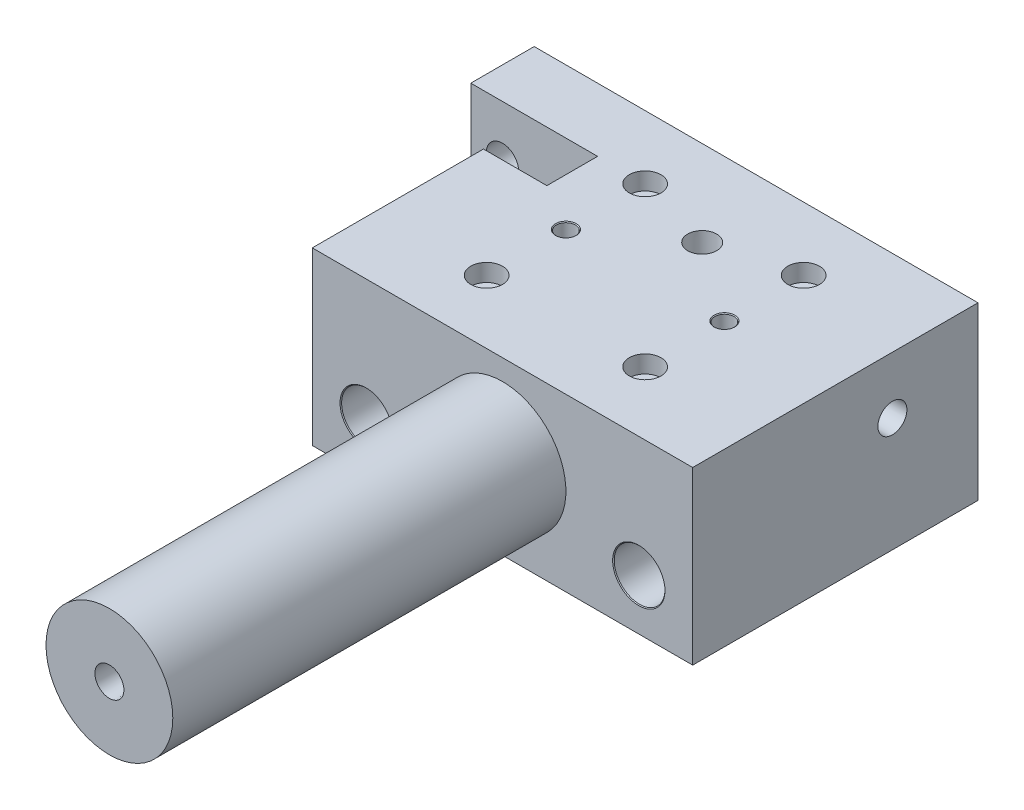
ISO-10303-21;
HEADER;
FILE_DESCRIPTION(('STEP AP214'),'2;1');
FILE_NAME('part.step','',(''),(''),'','','');
FILE_SCHEMA(('AUTOMOTIVE_DESIGN { 1 0 10303 214 1 1 1 1 }'));
ENDSEC;
DATA;
#1=APPLICATION_CONTEXT('core data for automotive mechanical design processes');
#2=APPLICATION_PROTOCOL_DEFINITION('international standard','automotive_design',2000,#1);
#3=PRODUCT_CONTEXT('',#1,'mechanical');
#4=PRODUCT('Part','Part','',(#3));
#5=PRODUCT_RELATED_PRODUCT_CATEGORY('part','',(#4));
#6=PRODUCT_DEFINITION_FORMATION('','',#4);
#7=PRODUCT_DEFINITION_CONTEXT('part definition',#1,'design');
#8=PRODUCT_DEFINITION('design','',#6,#7);
#9=PRODUCT_DEFINITION_SHAPE('','',#8);
#10=(LENGTH_UNIT() NAMED_UNIT(*) SI_UNIT(.MILLI.,.METRE.));
#11=(NAMED_UNIT(*) PLANE_ANGLE_UNIT() SI_UNIT($,.RADIAN.));
#12=(NAMED_UNIT(*) SI_UNIT($,.STERADIAN.) SOLID_ANGLE_UNIT());
#13=UNCERTAINTY_MEASURE_WITH_UNIT(LENGTH_MEASURE(1.E-05),#10,'distance_accuracy_value','');
#14=(GEOMETRIC_REPRESENTATION_CONTEXT(3) GLOBAL_UNCERTAINTY_ASSIGNED_CONTEXT((#13)) GLOBAL_UNIT_ASSIGNED_CONTEXT((#10,
#11,#12)) REPRESENTATION_CONTEXT('',''));
#15=CARTESIAN_POINT('',(0.,0.,0.));
#16=DIRECTION('',(0.,0.,1.));
#17=DIRECTION('',(1.,0.,0.));
#18=AXIS2_PLACEMENT_3D('',#15,#16,#17);
#19=CARTESIAN_POINT('',(0.,4.,-81.));
#20=DIRECTION('',(-1.,0.,0.));
#21=DIRECTION('',(0.,0.,1.));
#22=AXIS2_PLACEMENT_3D('',#19,#20,#21);
#23=CYLINDRICAL_SURFACE('',#22,2.39999999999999);
#24=CARTESIAN_POINT('',(8.99999999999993,4.,-81.));
#25=DIRECTION('',(-1.,0.,0.));
#26=DIRECTION('',(0.,0.,1.));
#27=AXIS2_PLACEMENT_3D('',#24,#25,#26);
#28=CIRCLE('',#27,2.39999999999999);
#29=CARTESIAN_POINT('',(8.99999999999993,4.,-78.6));
#30=VERTEX_POINT('',#29);
#31=EDGE_CURVE('E9355',#30,#30,#28,.T.);
#32=ORIENTED_EDGE('',*,*,#31,.F.);
#33=EDGE_LOOP('',(#32));
#34=FACE_BOUND('',#33,.T.);
#35=CARTESIAN_POINT('',(4.5,4.,-81.));
#36=DIRECTION('',(-1.,0.,0.));
#37=DIRECTION('',(0.,0.,1.));
#38=AXIS2_PLACEMENT_3D('',#35,#36,#37);
#39=CIRCLE('',#38,2.39999999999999);
#40=CARTESIAN_POINT('',(4.5,4.,-78.6));
#41=VERTEX_POINT('',#40);
#42=EDGE_CURVE('E9342',#41,#41,#39,.F.);
#43=ORIENTED_EDGE('',*,*,#42,.F.);
#44=EDGE_LOOP('',(#43));
#45=FACE_BOUND('',#44,.T.);
#46=ADVANCED_FACE('F9174',(#34,#45),#23,.F.);
#47=CARTESIAN_POINT('',(0.,54.,-90.));
#48=DIRECTION('',(1.,0.,0.));
#49=DIRECTION('',(0.,0.,-1.));
#50=AXIS2_PLACEMENT_3D('',#47,#48,#49);
#51=PLANE('',#50);
#52=CARTESIAN_POINT('',(0.,4.,-81.));
#53=DIRECTION('',(-1.,0.,0.));
#54=DIRECTION('',(0.,0.,1.));
#55=AXIS2_PLACEMENT_3D('',#52,#53,#54);
#56=CIRCLE('',#55,4.00000000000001);
#57=CARTESIAN_POINT('',(0.,3.85832158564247,-77.0025098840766));
#58=VERTEX_POINT('',#57);
#59=CARTESIAN_POINT('',(0.,4.,-85.));
#60=VERTEX_POINT('',#59);
#61=EDGE_CURVE('E9321',#58,#60,#56,.T.);
#62=ORIENTED_EDGE('',*,*,#61,.F.);
#63=DIRECTION('',(0.,1.,0.));
#64=VECTOR('',#63,1.);
#65=CARTESIAN_POINT('',(0.,3.85832158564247,-77.0025098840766));
#66=LINE('',#65,#64);
#67=CARTESIAN_POINT('',(0.,0.,-77.0025098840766));
#68=VERTEX_POINT('',#67);
#69=EDGE_CURVE('E9328',#68,#58,#66,.T.);
#70=ORIENTED_EDGE('',*,*,#69,.F.);
#71=DIRECTION('',(0.,0.,1.));
#72=VECTOR('',#71,1.);
#73=CARTESIAN_POINT('',(0.,0.,-90.));
#74=LINE('',#73,#72);
#75=CARTESIAN_POINT('',(0.,0.,-70.));
#76=VERTEX_POINT('',#75);
#77=EDGE_CURVE('E9548',#68,#76,#74,.T.);
#78=ORIENTED_EDGE('',*,*,#77,.T.);
#79=DIRECTION('',(0.,-1.,0.));
#80=VECTOR('',#79,1.);
#81=CARTESIAN_POINT('',(0.,54.,-70.));
#82=LINE('',#81,#80);
#83=CARTESIAN_POINT('',(0.,54.,-70.));
#84=VERTEX_POINT('',#83);
#85=EDGE_CURVE('E9580',#84,#76,#82,.T.);
#86=ORIENTED_EDGE('',*,*,#85,.F.);
#87=DIRECTION('',(0.,0.,1.));
#88=VECTOR('',#87,1.);
#89=CARTESIAN_POINT('',(0.,54.,-90.));
#90=LINE('',#89,#88);
#91=CARTESIAN_POINT('',(0.,54.,-90.));
#92=VERTEX_POINT('',#91);
#93=EDGE_CURVE('E9565',#92,#84,#90,.T.);
#94=ORIENTED_EDGE('',*,*,#93,.F.);
#95=DIRECTION('',(0.,-1.,0.));
#96=VECTOR('',#95,1.);
#97=CARTESIAN_POINT('',(0.,54.,-90.));
#98=LINE('',#97,#96);
#99=CARTESIAN_POINT('',(0.,0.,-90.));
#100=VERTEX_POINT('',#99);
#101=EDGE_CURVE('E9583',#92,#100,#98,.T.);
#102=ORIENTED_EDGE('',*,*,#101,.T.);
#103=CARTESIAN_POINT('',(0.,0.,-85.));
#104=VERTEX_POINT('',#103);
#105=EDGE_CURVE('E9549',#100,#104,#74,.T.);
#106=ORIENTED_EDGE('',*,*,#105,.T.);
#107=DIRECTION('',(0.,-1.,0.));
#108=VECTOR('',#107,1.);
#109=CARTESIAN_POINT('',(0.,4.,-85.));
#110=LINE('',#109,#108);
#111=EDGE_CURVE('E9326',#60,#104,#110,.T.);
#112=ORIENTED_EDGE('',*,*,#111,.F.);
#113=EDGE_LOOP('',(#62,#70,#78,#86,#94,#102,#106,#112));
#114=FACE_BOUND('',#113,.T.);
#115=ADVANCED_FACE('F9645',(#114),#51,.F.);
#116=CARTESIAN_POINT('',(140.,0.,-90.));
#117=DIRECTION('',(0.,-1.,0.));
#118=DIRECTION('',(0.,0.,-1.));
#119=AXIS2_PLACEMENT_3D('',#116,#117,#118);
#120=PLANE('',#119);
#121=DIRECTION('',(-1.,0.,0.));
#122=VECTOR('',#121,1.);
#123=CARTESIAN_POINT('',(4.5,0.,-77.0025098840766));
#124=LINE('',#123,#122);
#125=CARTESIAN_POINT('',(4.5,0.,-77.0025098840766));
#126=VERTEX_POINT('',#125);
#127=EDGE_CURVE('E9343',#126,#68,#124,.T.);
#128=ORIENTED_EDGE('',*,*,#127,.F.);
#129=DIRECTION('',(0.,0.,1.));
#130=VECTOR('',#129,1.);
#131=CARTESIAN_POINT('',(4.5,0.,-85.));
#132=LINE('',#131,#130);
#133=CARTESIAN_POINT('',(4.5,0.,-85.));
#134=VERTEX_POINT('',#133);
#135=EDGE_CURVE('E9334',#134,#126,#132,.T.);
#136=ORIENTED_EDGE('',*,*,#135,.F.);
#137=DIRECTION('',(-1.,0.,0.));
#138=VECTOR('',#137,1.);
#139=CARTESIAN_POINT('',(4.5,0.,-85.));
#140=LINE('',#139,#138);
#141=EDGE_CURVE('E9345',#134,#104,#140,.T.);
#142=ORIENTED_EDGE('',*,*,#141,.T.);
#143=ORIENTED_EDGE('',*,*,#105,.F.);
#144=DIRECTION('',(-1.,0.,0.));
#145=VECTOR('',#144,1.);
#146=CARTESIAN_POINT('',(0.,0.,-90.));
#147=LINE('',#146,#145);
#148=CARTESIAN_POINT('',(8.99999999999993,0.,-90.));
#149=VERTEX_POINT('',#148);
#150=EDGE_CURVE('E9544',#149,#100,#147,.T.);
#151=ORIENTED_EDGE('',*,*,#150,.F.);
#152=DIRECTION('',(0.,0.,-1.));
#153=VECTOR('',#152,1.);
#154=CARTESIAN_POINT('',(8.99999999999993,0.,-69.));
#155=LINE('',#154,#153);
#156=CARTESIAN_POINT('',(8.99999999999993,0.,-70.));
#157=VERTEX_POINT('',#156);
#158=EDGE_CURVE('E9358',#157,#149,#155,.T.);
#159=ORIENTED_EDGE('',*,*,#158,.F.);
#160=DIRECTION('',(1.,0.,0.));
#161=VECTOR('',#160,1.);
#162=CARTESIAN_POINT('',(0.,0.,-70.));
#163=LINE('',#162,#161);
#164=EDGE_CURVE('E9553',#76,#157,#163,.T.);
#165=ORIENTED_EDGE('',*,*,#164,.F.);
#166=ORIENTED_EDGE('',*,*,#77,.F.);
#167=EDGE_LOOP('',(#128,#136,#142,#143,#151,#159,#165,#166));
#168=FACE_BOUND('',#167,.T.);
#169=ADVANCED_FACE('F9652',(#168),#120,.T.);
#170=CARTESIAN_POINT('',(20.,54.,0.));
#171=DIRECTION('',(0.,0.,-1.));
#172=DIRECTION('',(-1.,0.,0.));
#173=AXIS2_PLACEMENT_3D('',#170,#171,#172);
#174=PLANE('',#173);
#175=DIRECTION('',(1.,0.,0.));
#176=VECTOR('',#175,1.);
#177=CARTESIAN_POINT('',(20.,0.,0.));
#178=LINE('',#177,#176);
#179=CARTESIAN_POINT('',(20.,0.,0.));
#180=VERTEX_POINT('',#179);
#181=CARTESIAN_POINT('',(140.,0.,0.));
#182=VERTEX_POINT('',#181);
#183=EDGE_CURVE('E9558',#180,#182,#178,.T.);
#184=ORIENTED_EDGE('',*,*,#183,.T.);
#185=DIRECTION('',(0.,-1.,0.));
#186=VECTOR('',#185,1.);
#187=CARTESIAN_POINT('',(140.,54.,0.));
#188=LINE('',#187,#186);
#189=CARTESIAN_POINT('',(140.,54.,0.));
#190=VERTEX_POINT('',#189);
#191=EDGE_CURVE('E9572',#190,#182,#188,.T.);
#192=ORIENTED_EDGE('',*,*,#191,.F.);
#193=DIRECTION('',(1.,0.,0.));
#194=VECTOR('',#193,1.);
#195=CARTESIAN_POINT('',(20.,54.,0.));
#196=LINE('',#195,#194);
#197=CARTESIAN_POINT('',(20.,54.,0.));
#198=VERTEX_POINT('',#197);
#199=EDGE_CURVE('E9570',#198,#190,#196,.T.);
#200=ORIENTED_EDGE('',*,*,#199,.F.);
#201=DIRECTION('',(0.,-1.,0.));
#202=VECTOR('',#201,1.);
#203=CARTESIAN_POINT('',(20.,54.,0.));
#204=LINE('',#203,#202);
#205=EDGE_CURVE('E9575',#198,#180,#204,.T.);
#206=ORIENTED_EDGE('',*,*,#205,.T.);
#207=EDGE_LOOP('',(#184,#192,#200,#206));
#208=FACE_BOUND('',#207,.T.);
#209=CARTESIAN_POINT('',(37.,16.,0.));
#210=DIRECTION('',(0.,0.,1.));
#211=DIRECTION('',(1.,0.,0.));
#212=AXIS2_PLACEMENT_3D('',#209,#210,#211);
#213=CIRCLE('',#212,8.25);
#214=CARTESIAN_POINT('',(45.25,16.,0.));
#215=VERTEX_POINT('',#214);
#216=EDGE_CURVE('E9526',#215,#215,#213,.T.);
#217=ORIENTED_EDGE('',*,*,#216,.F.);
#218=EDGE_LOOP('',(#217));
#219=FACE_BOUND('',#218,.T.);
#220=CARTESIAN_POINT('',(123.,16.,0.));
#221=DIRECTION('',(0.,0.,1.));
#222=DIRECTION('',(1.,0.,0.));
#223=AXIS2_PLACEMENT_3D('',#220,#221,#222);
#224=CIRCLE('',#223,8.24999999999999);
#225=CARTESIAN_POINT('',(131.25,16.,0.));
#226=VERTEX_POINT('',#225);
#227=EDGE_CURVE('E9514',#226,#226,#224,.T.);
#228=ORIENTED_EDGE('',*,*,#227,.F.);
#229=EDGE_LOOP('',(#228));
#230=FACE_BOUND('',#229,.T.);
#231=CARTESIAN_POINT('',(80.,27.5,0.));
#232=DIRECTION('',(0.,0.,-1.));
#233=DIRECTION('',(-1.,0.,0.));
#234=AXIS2_PLACEMENT_3D('',#231,#232,#233);
#235=CIRCLE('',#234,20.);
#236=CARTESIAN_POINT('',(60.,27.5,0.));
#237=VERTEX_POINT('',#236);
#238=EDGE_CURVE('E9589',#237,#237,#235,.F.);
#239=ORIENTED_EDGE('',*,*,#238,.F.);
#240=EDGE_LOOP('',(#239));
#241=FACE_BOUND('',#240,.T.);
#242=ADVANCED_FACE('F9626',(#208,#219,#230,#241),#174,.F.);
#243=DIRECTION('',(0.,0.,1.));
#244=VECTOR('',#243,1.);
#245=CARTESIAN_POINT('',(10.9999999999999,0.,-69.));
#246=LINE('',#245,#244);
#247=CARTESIAN_POINT('',(10.9999999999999,0.,-90.));
#248=VERTEX_POINT('',#247);
#249=CARTESIAN_POINT('',(10.9999999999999,0.,-70.));
#250=VERTEX_POINT('',#249);
#251=EDGE_CURVE('E9360',#248,#250,#246,.T.);
#252=ORIENTED_EDGE('',*,*,#251,.F.);
#253=CARTESIAN_POINT('',(140.,0.,-90.));
#254=VERTEX_POINT('',#253);
#255=EDGE_CURVE('E9545',#254,#248,#147,.T.);
#256=ORIENTED_EDGE('',*,*,#255,.F.);
#257=DIRECTION('',(0.,0.,-1.));
#258=VECTOR('',#257,1.);
#259=CARTESIAN_POINT('',(140.,0.,0.));
#260=LINE('',#259,#258);
#261=EDGE_CURVE('E9541',#182,#254,#260,.T.);
#262=ORIENTED_EDGE('',*,*,#261,.F.);
#263=ORIENTED_EDGE('',*,*,#183,.F.);
#264=DIRECTION('',(0.,0.,1.));
#265=VECTOR('',#264,1.);
#266=CARTESIAN_POINT('',(19.9999999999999,0.,-70.));
#267=LINE('',#266,#265);
#268=CARTESIAN_POINT('',(19.9999999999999,0.,-70.));
#269=VERTEX_POINT('',#268);
#270=EDGE_CURVE('E9556',#269,#180,#267,.T.);
#271=ORIENTED_EDGE('',*,*,#270,.F.);
#272=EDGE_CURVE('E9552',#250,#269,#163,.T.);
#273=ORIENTED_EDGE('',*,*,#272,.F.);
#274=EDGE_LOOP('',(#252,#256,#262,#263,#271,#273));
#275=FACE_BOUND('',#274,.T.);
#276=CARTESIAN_POINT('',(80.,0.,-63.));
#277=DIRECTION('',(0.,-1.,0.));
#278=DIRECTION('',(0.,0.,-1.));
#279=AXIS2_PLACEMENT_3D('',#276,#277,#278);
#280=CIRCLE('',#279,4.57349999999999);
#281=CARTESIAN_POINT('',(80.,0.,-67.5735));
#282=VERTEX_POINT('',#281);
#283=EDGE_CURVE('E9422',#282,#282,#280,.T.);
#284=ORIENTED_EDGE('',*,*,#283,.F.);
#285=EDGE_LOOP('',(#284));
#286=FACE_BOUND('',#285,.T.);
#287=CARTESIAN_POINT('',(55.,0.,-20.));
#288=DIRECTION('',(0.,-1.,0.));
#289=DIRECTION('',(0.,0.,-1.));
#290=AXIS2_PLACEMENT_3D('',#287,#288,#289);
#291=CIRCLE('',#290,5.);
#292=CARTESIAN_POINT('',(55.,0.,-25.));
#293=VERTEX_POINT('',#292);
#294=EDGE_CURVE('E9425',#293,#293,#291,.T.);
#295=ORIENTED_EDGE('',*,*,#294,.F.);
#296=EDGE_LOOP('',(#295));
#297=FACE_BOUND('',#296,.T.);
#298=CARTESIAN_POINT('',(55.,0.,-70.));
#299=DIRECTION('',(0.,-1.,0.));
#300=DIRECTION('',(0.,0.,-1.));
#301=AXIS2_PLACEMENT_3D('',#298,#299,#300);
#302=CIRCLE('',#301,5.);
#303=CARTESIAN_POINT('',(55.,0.,-75.));
#304=VERTEX_POINT('',#303);
#305=EDGE_CURVE('E9453',#304,#304,#302,.T.);
#306=ORIENTED_EDGE('',*,*,#305,.F.);
#307=EDGE_LOOP('',(#306));
#308=FACE_BOUND('',#307,.T.);
#309=CARTESIAN_POINT('',(105.,0.,-45.));
#310=DIRECTION('',(0.,-1.,0.));
#311=DIRECTION('',(0.,0.,-1.));
#312=AXIS2_PLACEMENT_3D('',#309,#310,#311);
#313=CIRCLE('',#312,3.25);
#314=CARTESIAN_POINT('',(105.,0.,-48.25));
#315=VERTEX_POINT('',#314);
#316=EDGE_CURVE('E9490',#315,#315,#313,.T.);
#317=ORIENTED_EDGE('',*,*,#316,.F.);
#318=EDGE_LOOP('',(#317));
#319=FACE_BOUND('',#318,.T.);
#320=CARTESIAN_POINT('',(55.,0.,-45.));
#321=DIRECTION('',(0.,-1.,0.));
#322=DIRECTION('',(0.,0.,-1.));
#323=AXIS2_PLACEMENT_3D('',#320,#321,#322);
#324=CIRCLE('',#323,3.25);
#325=CARTESIAN_POINT('',(55.,0.,-48.25));
#326=VERTEX_POINT('',#325);
#327=EDGE_CURVE('E9502',#326,#326,#324,.T.);
#328=ORIENTED_EDGE('',*,*,#327,.F.);
#329=EDGE_LOOP('',(#328));
#330=FACE_BOUND('',#329,.T.);
#331=CARTESIAN_POINT('',(105.,0.,-70.));
#332=DIRECTION('',(0.,-1.,0.));
#333=DIRECTION('',(0.,0.,-1.));
#334=AXIS2_PLACEMENT_3D('',#331,#332,#333);
#335=CIRCLE('',#334,5.);
#336=CARTESIAN_POINT('',(105.,0.,-75.));
#337=VERTEX_POINT('',#336);
#338=EDGE_CURVE('E9467',#337,#337,#335,.T.);
#339=ORIENTED_EDGE('',*,*,#338,.F.);
#340=EDGE_LOOP('',(#339));
#341=FACE_BOUND('',#340,.T.);
#342=CARTESIAN_POINT('',(105.,0.,-20.));
#343=DIRECTION('',(0.,-1.,0.));
#344=DIRECTION('',(0.,0.,-1.));
#345=AXIS2_PLACEMENT_3D('',#342,#343,#344);
#346=CIRCLE('',#345,5.);
#347=CARTESIAN_POINT('',(105.,0.,-25.));
#348=VERTEX_POINT('',#347);
#349=EDGE_CURVE('E9439',#348,#348,#346,.T.);
#350=ORIENTED_EDGE('',*,*,#349,.F.);
#351=EDGE_LOOP('',(#350));
#352=FACE_BOUND('',#351,.T.);
#353=ADVANCED_FACE('F9631',(#275,#286,#297,#308,#319,#330,#341,#352),#120,.T.);
#354=CARTESIAN_POINT('',(140.,54.,0.));
#355=DIRECTION('',(-1.,0.,0.));
#356=DIRECTION('',(0.,0.,1.));
#357=AXIS2_PLACEMENT_3D('',#354,#355,#356);
#358=PLANE('',#357);
#359=CARTESIAN_POINT('',(140.,36.,-63.));
#360=DIRECTION('',(1.,0.,0.));
#361=DIRECTION('',(0.,0.,-1.));
#362=AXIS2_PLACEMENT_3D('',#359,#360,#361);
#363=CIRCLE('',#362,4.5735);
#364=CARTESIAN_POINT('',(140.,36.,-67.5735));
#365=VERTEX_POINT('',#364);
#366=EDGE_CURVE('E9398',#365,#365,#363,.T.);
#367=ORIENTED_EDGE('',*,*,#366,.F.);
#368=EDGE_LOOP('',(#367));
#369=FACE_BOUND('',#368,.T.);
#370=ORIENTED_EDGE('',*,*,#261,.T.);
#371=DIRECTION('',(0.,-1.,0.));
#372=VECTOR('',#371,1.);
#373=CARTESIAN_POINT('',(140.,54.,-90.));
#374=LINE('',#373,#372);
#375=CARTESIAN_POINT('',(140.,54.,-90.));
#376=VERTEX_POINT('',#375);
#377=EDGE_CURVE('E9586',#376,#254,#374,.T.);
#378=ORIENTED_EDGE('',*,*,#377,.F.);
#379=DIRECTION('',(0.,0.,-1.));
#380=VECTOR('',#379,1.);
#381=CARTESIAN_POINT('',(140.,54.,0.));
#382=LINE('',#381,#380);
#383=EDGE_CURVE('E9560',#190,#376,#382,.T.);
#384=ORIENTED_EDGE('',*,*,#383,.F.);
#385=ORIENTED_EDGE('',*,*,#191,.T.);
#386=EDGE_LOOP('',(#370,#378,#384,#385));
#387=FACE_BOUND('',#386,.T.);
#388=ADVANCED_FACE('F9176',(#369,#387),#358,.F.);
#389=CARTESIAN_POINT('',(0.,54.,-90.));
#390=DIRECTION('',(0.,0.,1.));
#391=DIRECTION('',(1.,0.,0.));
#392=AXIS2_PLACEMENT_3D('',#389,#390,#391);
#393=PLANE('',#392);
#394=CARTESIAN_POINT('',(123.,16.,-90.));
#395=DIRECTION('',(0.,0.,1.));
#396=DIRECTION('',(1.,0.,0.));
#397=AXIS2_PLACEMENT_3D('',#394,#395,#396);
#398=CIRCLE('',#397,8.24999999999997);
#399=CARTESIAN_POINT('',(131.25,16.,-90.));
#400=VERTEX_POINT('',#399);
#401=EDGE_CURVE('E9505',#400,#400,#398,.T.);
#402=ORIENTED_EDGE('',*,*,#401,.T.);
#403=EDGE_LOOP('',(#402));
#404=FACE_BOUND('',#403,.T.);
#405=CARTESIAN_POINT('',(37.,16.,-90.));
#406=DIRECTION('',(0.,0.,1.));
#407=DIRECTION('',(1.,0.,0.));
#408=AXIS2_PLACEMENT_3D('',#405,#406,#407);
#409=CIRCLE('',#408,8.24999999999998);
#410=CARTESIAN_POINT('',(45.25,16.,-90.));
#411=VERTEX_POINT('',#410);
#412=EDGE_CURVE('E9517',#411,#411,#409,.T.);
#413=ORIENTED_EDGE('',*,*,#412,.T.);
#414=EDGE_LOOP('',(#413));
#415=FACE_BOUND('',#414,.T.);
#416=CARTESIAN_POINT('',(9.99999999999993,37.5,-90.));
#417=DIRECTION('',(0.,0.,1.));
#418=DIRECTION('',(1.,0.,0.));
#419=AXIS2_PLACEMENT_3D('',#416,#417,#418);
#420=CIRCLE('',#419,5.1);
#421=CARTESIAN_POINT('',(15.0999999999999,37.5,-90.));
#422=VERTEX_POINT('',#421);
#423=EDGE_CURVE('E9529',#422,#422,#420,.T.);
#424=ORIENTED_EDGE('',*,*,#423,.T.);
#425=EDGE_LOOP('',(#424));
#426=FACE_BOUND('',#425,.T.);
#427=CARTESIAN_POINT('',(9.99999999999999,13.5,-90.));
#428=DIRECTION('',(0.,0.,1.));
#429=DIRECTION('',(1.,0.,0.));
#430=AXIS2_PLACEMENT_3D('',#427,#428,#429);
#431=CIRCLE('',#430,6.);
#432=CARTESIAN_POINT('',(10.9999999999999,7.58392021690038,-90.));
#433=VERTEX_POINT('',#432);
#434=CARTESIAN_POINT('',(8.99999999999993,7.5839202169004,-90.));
#435=VERTEX_POINT('',#434);
#436=EDGE_CURVE('E9535',#433,#435,#431,.T.);
#437=ORIENTED_EDGE('',*,*,#436,.T.);
#438=DIRECTION('',(0.,-1.,0.));
#439=VECTOR('',#438,1.);
#440=CARTESIAN_POINT('',(8.99999999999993,54.,-90.));
#441=LINE('',#440,#439);
#442=EDGE_CURVE('E9371',#435,#149,#441,.T.);
#443=ORIENTED_EDGE('',*,*,#442,.T.);
#444=ORIENTED_EDGE('',*,*,#150,.T.);
#445=ORIENTED_EDGE('',*,*,#101,.F.);
#446=DIRECTION('',(-1.,0.,0.));
#447=VECTOR('',#446,1.);
#448=CARTESIAN_POINT('',(0.,54.,-90.));
#449=LINE('',#448,#447);
#450=EDGE_CURVE('E9563',#376,#92,#449,.T.);
#451=ORIENTED_EDGE('',*,*,#450,.F.);
#452=ORIENTED_EDGE('',*,*,#377,.T.);
#453=ORIENTED_EDGE('',*,*,#255,.T.);
#454=DIRECTION('',(0.,1.,0.));
#455=VECTOR('',#454,1.);
#456=CARTESIAN_POINT('',(10.9999999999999,54.,-90.));
#457=LINE('',#456,#455);
#458=EDGE_CURVE('E9365',#248,#433,#457,.T.);
#459=ORIENTED_EDGE('',*,*,#458,.T.);
#460=EDGE_LOOP('',(#437,#443,#444,#445,#451,#452,#453,#459));
#461=FACE_BOUND('',#460,.T.);
#462=ADVANCED_FACE('F9640',(#404,#415,#426,#461),#393,.F.);
#463=CARTESIAN_POINT('',(0.,54.,-70.));
#464=DIRECTION('',(0.,0.,-1.));
#465=DIRECTION('',(-1.,0.,0.));
#466=AXIS2_PLACEMENT_3D('',#463,#464,#465);
#467=PLANE('',#466);
#468=CARTESIAN_POINT('',(9.99999999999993,37.5,-70.));
#469=DIRECTION('',(0.,0.,1.));
#470=DIRECTION('',(1.,0.,0.));
#471=AXIS2_PLACEMENT_3D('',#468,#469,#470);
#472=CIRCLE('',#471,5.1);
#473=CARTESIAN_POINT('',(15.0999999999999,37.5,-70.));
#474=VERTEX_POINT('',#473);
#475=EDGE_CURVE('E9532',#474,#474,#472,.T.);
#476=ORIENTED_EDGE('',*,*,#475,.F.);
#477=EDGE_LOOP('',(#476));
#478=FACE_BOUND('',#477,.T.);
#479=DIRECTION('',(0.,-1.,0.));
#480=VECTOR('',#479,1.);
#481=CARTESIAN_POINT('',(19.9999999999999,54.,-70.));
#482=LINE('',#481,#480);
#483=CARTESIAN_POINT('',(19.9999999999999,34.,-70.));
#484=VERTEX_POINT('',#483);
#485=EDGE_CURVE('E9578',#484,#269,#482,.T.);
#486=ORIENTED_EDGE('',*,*,#485,.F.);
#487=DIRECTION('',(-0.707106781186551,-0.707106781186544,0.));
#488=VECTOR('',#487,1.);
#489=CARTESIAN_POINT('',(19.9999999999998,34.,-70.));
#490=LINE('',#489,#488);
#491=CARTESIAN_POINT('',(39.9999999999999,54.,-70.));
#492=VERTEX_POINT('',#491);
#493=EDGE_CURVE('E9182',#484,#492,#490,.F.);
#494=ORIENTED_EDGE('',*,*,#493,.T.);
#495=DIRECTION('',(1.,0.,0.));
#496=VECTOR('',#495,1.);
#497=CARTESIAN_POINT('',(0.,54.,-70.));
#498=LINE('',#497,#496);
#499=EDGE_CURVE('E9311',#84,#492,#498,.T.);
#500=ORIENTED_EDGE('',*,*,#499,.F.);
#501=ORIENTED_EDGE('',*,*,#85,.T.);
#502=ORIENTED_EDGE('',*,*,#164,.T.);
#503=DIRECTION('',(0.,1.,0.));
#504=VECTOR('',#503,1.);
#505=CARTESIAN_POINT('',(8.99999999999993,54.,-70.));
#506=LINE('',#505,#504);
#507=CARTESIAN_POINT('',(8.99999999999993,7.5839202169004,-70.));
#508=VERTEX_POINT('',#507);
#509=EDGE_CURVE('E9368',#157,#508,#506,.T.);
#510=ORIENTED_EDGE('',*,*,#509,.T.);
#511=CARTESIAN_POINT('',(9.99999999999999,13.5,-70.));
#512=DIRECTION('',(0.,0.,1.));
#513=DIRECTION('',(1.,0.,0.));
#514=AXIS2_PLACEMENT_3D('',#511,#512,#513);
#515=CIRCLE('',#514,6.);
#516=CARTESIAN_POINT('',(10.9999999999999,7.58392021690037,-70.));
#517=VERTEX_POINT('',#516);
#518=EDGE_CURVE('E9538',#517,#508,#515,.T.);
#519=ORIENTED_EDGE('',*,*,#518,.F.);
#520=DIRECTION('',(0.,-1.,0.));
#521=VECTOR('',#520,1.);
#522=CARTESIAN_POINT('',(10.9999999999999,54.,-70.));
#523=LINE('',#522,#521);
#524=EDGE_CURVE('E9362',#517,#250,#523,.T.);
#525=ORIENTED_EDGE('',*,*,#524,.T.);
#526=ORIENTED_EDGE('',*,*,#272,.T.);
#527=EDGE_LOOP('',(#486,#494,#500,#501,#502,#510,#519,#525,#526));
#528=FACE_BOUND('',#527,.T.);
#529=ADVANCED_FACE('F9616',(#478,#528),#467,.F.);
#530=CARTESIAN_POINT('',(19.9999999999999,54.,-70.));
#531=DIRECTION('',(1.,0.,0.));
#532=DIRECTION('',(0.,0.,-1.));
#533=AXIS2_PLACEMENT_3D('',#530,#531,#532);
#534=PLANE('',#533);
#535=DIRECTION('',(0.,0.,1.));
#536=VECTOR('',#535,1.);
#537=CARTESIAN_POINT('',(19.9999999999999,54.,-70.));
#538=LINE('',#537,#536);
#539=CARTESIAN_POINT('',(19.9999999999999,54.,-54.));
#540=VERTEX_POINT('',#539);
#541=EDGE_CURVE('E9568',#540,#198,#538,.T.);
#542=ORIENTED_EDGE('',*,*,#541,.F.);
#543=DIRECTION('',(0.,1.,0.));
#544=VECTOR('',#543,1.);
#545=CARTESIAN_POINT('',(19.9999999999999,34.,-54.));
#546=LINE('',#545,#544);
#547=CARTESIAN_POINT('',(19.9999999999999,34.,-54.));
#548=VERTEX_POINT('',#547);
#549=EDGE_CURVE('E9188',#548,#540,#546,.T.);
#550=ORIENTED_EDGE('',*,*,#549,.F.);
#551=DIRECTION('',(0.,0.,1.));
#552=VECTOR('',#551,1.);
#553=CARTESIAN_POINT('',(19.9999999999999,34.,-54.));
#554=LINE('',#553,#552);
#555=EDGE_CURVE('E9313',#484,#548,#554,.T.);
#556=ORIENTED_EDGE('',*,*,#555,.F.);
#557=ORIENTED_EDGE('',*,*,#485,.T.);
#558=ORIENTED_EDGE('',*,*,#270,.T.);
#559=ORIENTED_EDGE('',*,*,#205,.F.);
#560=EDGE_LOOP('',(#542,#550,#556,#557,#558,#559));
#561=FACE_BOUND('',#560,.T.);
#562=ADVANCED_FACE('F9620',(#561),#534,.F.);
#563=CARTESIAN_POINT('',(140.,54.,-90.));
#564=DIRECTION('',(0.,-1.,0.));
#565=DIRECTION('',(0.,0.,-1.));
#566=AXIS2_PLACEMENT_3D('',#563,#564,#565);
#567=PLANE('',#566);
#568=CARTESIAN_POINT('',(80.,54.,-63.));
#569=DIRECTION('',(0.,1.,0.));
#570=DIRECTION('',(0.,0.,1.));
#571=AXIS2_PLACEMENT_3D('',#568,#569,#570);
#572=CIRCLE('',#571,4.57349999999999);
#573=CARTESIAN_POINT('',(80.,54.,-58.4265));
#574=VERTEX_POINT('',#573);
#575=EDGE_CURVE('E9401',#574,#574,#572,.T.);
#576=ORIENTED_EDGE('',*,*,#575,.F.);
#577=EDGE_LOOP('',(#576));
#578=FACE_BOUND('',#577,.T.);
#579=CARTESIAN_POINT('',(55.,54.,-20.));
#580=DIRECTION('',(0.,1.,0.));
#581=DIRECTION('',(0.,0.,1.));
#582=AXIS2_PLACEMENT_3D('',#579,#580,#581);
#583=CIRCLE('',#582,5.);
#584=CARTESIAN_POINT('',(55.,54.,-15.));
#585=VERTEX_POINT('',#584);
#586=EDGE_CURVE('E9432',#585,#585,#583,.T.);
#587=ORIENTED_EDGE('',*,*,#586,.F.);
#588=EDGE_LOOP('',(#587));
#589=FACE_BOUND('',#588,.T.);
#590=CARTESIAN_POINT('',(105.,54.,-20.));
#591=DIRECTION('',(0.,1.,0.));
#592=DIRECTION('',(0.,0.,1.));
#593=AXIS2_PLACEMENT_3D('',#590,#591,#592);
#594=CIRCLE('',#593,5.);
#595=CARTESIAN_POINT('',(105.,54.,-15.));
#596=VERTEX_POINT('',#595);
#597=EDGE_CURVE('E9446',#596,#596,#594,.T.);
#598=ORIENTED_EDGE('',*,*,#597,.F.);
#599=EDGE_LOOP('',(#598));
#600=FACE_BOUND('',#599,.T.);
#601=CARTESIAN_POINT('',(55.,54.,-70.));
#602=DIRECTION('',(0.,1.,0.));
#603=DIRECTION('',(0.,0.,1.));
#604=AXIS2_PLACEMENT_3D('',#601,#602,#603);
#605=CIRCLE('',#604,5.);
#606=CARTESIAN_POINT('',(55.,54.,-65.));
#607=VERTEX_POINT('',#606);
#608=EDGE_CURVE('E9460',#607,#607,#605,.T.);
#609=ORIENTED_EDGE('',*,*,#608,.F.);
#610=EDGE_LOOP('',(#609));
#611=FACE_BOUND('',#610,.T.);
#612=CARTESIAN_POINT('',(105.,54.,-70.));
#613=DIRECTION('',(0.,1.,0.));
#614=DIRECTION('',(0.,0.,1.));
#615=AXIS2_PLACEMENT_3D('',#612,#613,#614);
#616=CIRCLE('',#615,5.);
#617=CARTESIAN_POINT('',(105.,54.,-65.));
#618=VERTEX_POINT('',#617);
#619=EDGE_CURVE('E9477',#618,#618,#616,.T.);
#620=ORIENTED_EDGE('',*,*,#619,.F.);
#621=EDGE_LOOP('',(#620));
#622=FACE_BOUND('',#621,.T.);
#623=CARTESIAN_POINT('',(105.,54.,-45.));
#624=DIRECTION('',(0.,-1.,0.));
#625=DIRECTION('',(0.,0.,-1.));
#626=AXIS2_PLACEMENT_3D('',#623,#624,#625);
#627=CIRCLE('',#626,3.24999999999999);
#628=CARTESIAN_POINT('',(105.,54.,-48.25));
#629=VERTEX_POINT('',#628);
#630=EDGE_CURVE('E9481',#629,#629,#627,.T.);
#631=ORIENTED_EDGE('',*,*,#630,.T.);
#632=EDGE_LOOP('',(#631));
#633=FACE_BOUND('',#632,.T.);
#634=CARTESIAN_POINT('',(55.,54.,-45.));
#635=DIRECTION('',(0.,-1.,0.));
#636=DIRECTION('',(0.,0.,-1.));
#637=AXIS2_PLACEMENT_3D('',#634,#635,#636);
#638=CIRCLE('',#637,3.24999999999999);
#639=CARTESIAN_POINT('',(55.,54.,-48.25));
#640=VERTEX_POINT('',#639);
#641=EDGE_CURVE('E9493',#640,#640,#638,.T.);
#642=ORIENTED_EDGE('',*,*,#641,.T.);
#643=EDGE_LOOP('',(#642));
#644=FACE_BOUND('',#643,.T.);
#645=ORIENTED_EDGE('',*,*,#499,.T.);
#646=DIRECTION('',(0.,0.,-1.));
#647=VECTOR('',#646,1.);
#648=CARTESIAN_POINT('',(39.9999999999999,54.,-70.));
#649=LINE('',#648,#647);
#650=CARTESIAN_POINT('',(39.9999999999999,54.,-54.));
#651=VERTEX_POINT('',#650);
#652=EDGE_CURVE('E9305',#651,#492,#649,.T.);
#653=ORIENTED_EDGE('',*,*,#652,.F.);
#654=DIRECTION('',(1.,0.,0.));
#655=VECTOR('',#654,1.);
#656=CARTESIAN_POINT('',(39.9999999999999,54.,-54.));
#657=LINE('',#656,#655);
#658=EDGE_CURVE('E9299',#540,#651,#657,.T.);
#659=ORIENTED_EDGE('',*,*,#658,.F.);
#660=ORIENTED_EDGE('',*,*,#541,.T.);
#661=ORIENTED_EDGE('',*,*,#199,.T.);
#662=ORIENTED_EDGE('',*,*,#383,.T.);
#663=ORIENTED_EDGE('',*,*,#450,.T.);
#664=ORIENTED_EDGE('',*,*,#93,.T.);
#665=EDGE_LOOP('',(#645,#653,#659,#660,#661,#662,#663,#664));
#666=FACE_BOUND('',#665,.T.);
#667=ADVANCED_FACE('F9309',(#578,#589,#600,#611,#622,#633,#644,#666),#567,.F.);
#668=CARTESIAN_POINT('',(9.99999999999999,13.5,-70.));
#669=DIRECTION('',(0.,0.,1.));
#670=DIRECTION('',(1.,0.,0.));
#671=AXIS2_PLACEMENT_3D('',#668,#669,#670);
#672=CYLINDRICAL_SURFACE('',#671,6.);
#673=ORIENTED_EDGE('',*,*,#518,.T.);
#674=DIRECTION('',(0.,0.,1.));
#675=VECTOR('',#674,1.);
#676=CARTESIAN_POINT('',(8.99999999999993,7.5839202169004,-70.));
#677=LINE('',#676,#675);
#678=EDGE_CURVE('E9611',#508,#435,#677,.F.);
#679=ORIENTED_EDGE('',*,*,#678,.T.);
#680=ORIENTED_EDGE('',*,*,#436,.F.);
#681=DIRECTION('',(0.,0.,1.));
#682=VECTOR('',#681,1.);
#683=CARTESIAN_POINT('',(10.9999999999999,7.58392021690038,-70.));
#684=LINE('',#683,#682);
#685=EDGE_CURVE('E9608',#433,#517,#684,.T.);
#686=ORIENTED_EDGE('',*,*,#685,.T.);
#687=EDGE_LOOP('',(#673,#679,#680,#686));
#688=FACE_BOUND('',#687,.T.);
#689=ADVANCED_FACE('F9657',(#688),#672,.F.);
#690=CARTESIAN_POINT('',(9.99999999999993,37.5,-70.));
#691=DIRECTION('',(0.,0.,1.));
#692=DIRECTION('',(1.,0.,0.));
#693=AXIS2_PLACEMENT_3D('',#690,#691,#692);
#694=CYLINDRICAL_SURFACE('',#693,5.1);
#695=ORIENTED_EDGE('',*,*,#423,.F.);
#696=EDGE_LOOP('',(#695));
#697=FACE_BOUND('',#696,.T.);
#698=ORIENTED_EDGE('',*,*,#475,.T.);
#699=EDGE_LOOP('',(#698));
#700=FACE_BOUND('',#699,.T.);
#701=ADVANCED_FACE('F9789',(#697,#700),#694,.F.);
#702=CARTESIAN_POINT('',(37.,16.,0.));
#703=DIRECTION('',(0.,0.,1.));
#704=DIRECTION('',(1.,0.,0.));
#705=AXIS2_PLACEMENT_3D('',#702,#703,#704);
#706=CONICAL_SURFACE('',#705,8.25,0.785398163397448);
#707=CARTESIAN_POINT('',(37.,16.,-0.250000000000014));
#708=DIRECTION('',(0.,0.,1.));
#709=DIRECTION('',(1.,0.,0.));
#710=AXIS2_PLACEMENT_3D('',#707,#708,#709);
#711=CIRCLE('',#710,7.99999999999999);
#712=CARTESIAN_POINT('',(45.,16.,-0.250000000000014));
#713=VERTEX_POINT('',#712);
#714=EDGE_CURVE('E9523',#713,#713,#711,.T.);
#715=ORIENTED_EDGE('',*,*,#714,.F.);
#716=EDGE_LOOP('',(#715));
#717=FACE_BOUND('',#716,.T.);
#718=ORIENTED_EDGE('',*,*,#216,.T.);
#719=EDGE_LOOP('',(#718));
#720=FACE_BOUND('',#719,.T.);
#721=ADVANCED_FACE('F10199',(#717,#720),#706,.F.);
#722=CARTESIAN_POINT('',(37.,16.,0.));
#723=DIRECTION('',(0.,0.,1.));
#724=DIRECTION('',(1.,0.,0.));
#725=AXIS2_PLACEMENT_3D('',#722,#723,#724);
#726=CYLINDRICAL_SURFACE('',#725,7.99999999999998);
#727=CARTESIAN_POINT('',(37.,16.,-89.75));
#728=DIRECTION('',(0.,0.,1.));
#729=DIRECTION('',(1.,0.,0.));
#730=AXIS2_PLACEMENT_3D('',#727,#728,#729);
#731=CIRCLE('',#730,7.99999999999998);
#732=CARTESIAN_POINT('',(45.,16.,-89.75));
#733=VERTEX_POINT('',#732);
#734=EDGE_CURVE('E9520',#733,#733,#731,.T.);
#735=ORIENTED_EDGE('',*,*,#734,.F.);
#736=EDGE_LOOP('',(#735));
#737=FACE_BOUND('',#736,.T.);
#738=ORIENTED_EDGE('',*,*,#714,.T.);
#739=EDGE_LOOP('',(#738));
#740=FACE_BOUND('',#739,.T.);
#741=ADVANCED_FACE('F10191',(#737,#740),#726,.F.);
#742=CARTESIAN_POINT('',(37.,16.,-89.75));
#743=DIRECTION('',(0.,0.,-1.));
#744=DIRECTION('',(-1.,0.,0.));
#745=AXIS2_PLACEMENT_3D('',#742,#743,#744);
#746=CONICAL_SURFACE('',#745,7.99999999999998,0.785398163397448);
#747=ORIENTED_EDGE('',*,*,#412,.F.);
#748=EDGE_LOOP('',(#747));
#749=FACE_BOUND('',#748,.T.);
#750=ORIENTED_EDGE('',*,*,#734,.T.);
#751=EDGE_LOOP('',(#750));
#752=FACE_BOUND('',#751,.T.);
#753=ADVANCED_FACE('F10183',(#749,#752),#746,.F.);
#754=CARTESIAN_POINT('',(123.,16.,0.));
#755=DIRECTION('',(0.,0.,1.));
#756=DIRECTION('',(1.,0.,0.));
#757=AXIS2_PLACEMENT_3D('',#754,#755,#756);
#758=CONICAL_SURFACE('',#757,8.24999999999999,0.785398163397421);
#759=CARTESIAN_POINT('',(123.,16.,-0.250000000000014));
#760=DIRECTION('',(0.,0.,1.));
#761=DIRECTION('',(1.,0.,0.));
#762=AXIS2_PLACEMENT_3D('',#759,#760,#761);
#763=CIRCLE('',#762,7.99999999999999);
#764=CARTESIAN_POINT('',(131.,16.,-0.250000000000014));
#765=VERTEX_POINT('',#764);
#766=EDGE_CURVE('E9511',#765,#765,#763,.T.);
#767=ORIENTED_EDGE('',*,*,#766,.F.);
#768=EDGE_LOOP('',(#767));
#769=FACE_BOUND('',#768,.T.);
#770=ORIENTED_EDGE('',*,*,#227,.T.);
#771=EDGE_LOOP('',(#770));
#772=FACE_BOUND('',#771,.T.);
#773=ADVANCED_FACE('F10175',(#769,#772),#758,.F.);
#774=CARTESIAN_POINT('',(123.,16.,0.));
#775=DIRECTION('',(0.,0.,1.));
#776=DIRECTION('',(1.,0.,0.));
#777=AXIS2_PLACEMENT_3D('',#774,#775,#776);
#778=CYLINDRICAL_SURFACE('',#777,7.99999999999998);
#779=CARTESIAN_POINT('',(123.,16.,-89.75));
#780=DIRECTION('',(0.,0.,1.));
#781=DIRECTION('',(1.,0.,0.));
#782=AXIS2_PLACEMENT_3D('',#779,#780,#781);
#783=CIRCLE('',#782,7.99999999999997);
#784=CARTESIAN_POINT('',(131.,16.,-89.75));
#785=VERTEX_POINT('',#784);
#786=EDGE_CURVE('E9508',#785,#785,#783,.T.);
#787=ORIENTED_EDGE('',*,*,#786,.F.);
#788=EDGE_LOOP('',(#787));
#789=FACE_BOUND('',#788,.T.);
#790=ORIENTED_EDGE('',*,*,#766,.T.);
#791=EDGE_LOOP('',(#790));
#792=FACE_BOUND('',#791,.T.);
#793=ADVANCED_FACE('F10167',(#789,#792),#778,.F.);
#794=CARTESIAN_POINT('',(123.,16.,-89.75));
#795=DIRECTION('',(0.,0.,-1.));
#796=DIRECTION('',(-1.,0.,0.));
#797=AXIS2_PLACEMENT_3D('',#794,#795,#796);
#798=CONICAL_SURFACE('',#797,7.99999999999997,0.785398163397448);
#799=ORIENTED_EDGE('',*,*,#401,.F.);
#800=EDGE_LOOP('',(#799));
#801=FACE_BOUND('',#800,.T.);
#802=ORIENTED_EDGE('',*,*,#786,.T.);
#803=EDGE_LOOP('',(#802));
#804=FACE_BOUND('',#803,.T.);
#805=ADVANCED_FACE('F10159',(#801,#804),#798,.F.);
#806=CARTESIAN_POINT('',(55.,0.,-45.));
#807=DIRECTION('',(0.,-1.,0.));
#808=DIRECTION('',(0.,0.,-1.));
#809=AXIS2_PLACEMENT_3D('',#806,#807,#808);
#810=CONICAL_SURFACE('',#809,3.25,0.785398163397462);
#811=CARTESIAN_POINT('',(55.,0.25,-45.));
#812=DIRECTION('',(0.,-1.,0.));
#813=DIRECTION('',(0.,0.,-1.));
#814=AXIS2_PLACEMENT_3D('',#811,#812,#813);
#815=CIRCLE('',#814,3.);
#816=CARTESIAN_POINT('',(55.,0.25,-48.));
#817=VERTEX_POINT('',#816);
#818=EDGE_CURVE('E9499',#817,#817,#815,.T.);
#819=ORIENTED_EDGE('',*,*,#818,.F.);
#820=EDGE_LOOP('',(#819));
#821=FACE_BOUND('',#820,.T.);
#822=ORIENTED_EDGE('',*,*,#327,.T.);
#823=EDGE_LOOP('',(#822));
#824=FACE_BOUND('',#823,.T.);
#825=ADVANCED_FACE('F10151',(#821,#824),#810,.F.);
#826=CARTESIAN_POINT('',(55.,0.,-45.));
#827=DIRECTION('',(0.,-1.,0.));
#828=DIRECTION('',(0.,0.,-1.));
#829=AXIS2_PLACEMENT_3D('',#826,#827,#828);
#830=CYLINDRICAL_SURFACE('',#829,2.99999999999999);
#831=CARTESIAN_POINT('',(55.,53.75,-45.));
#832=DIRECTION('',(0.,-1.,0.));
#833=DIRECTION('',(0.,0.,-1.));
#834=AXIS2_PLACEMENT_3D('',#831,#832,#833);
#835=CIRCLE('',#834,2.99999999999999);
#836=CARTESIAN_POINT('',(55.,53.75,-48.));
#837=VERTEX_POINT('',#836);
#838=EDGE_CURVE('E9496',#837,#837,#835,.T.);
#839=ORIENTED_EDGE('',*,*,#838,.F.);
#840=EDGE_LOOP('',(#839));
#841=FACE_BOUND('',#840,.T.);
#842=ORIENTED_EDGE('',*,*,#818,.T.);
#843=EDGE_LOOP('',(#842));
#844=FACE_BOUND('',#843,.T.);
#845=ADVANCED_FACE('F10143',(#841,#844),#830,.F.);
#846=CARTESIAN_POINT('',(55.,53.75,-45.));
#847=DIRECTION('',(0.,1.,0.));
#848=DIRECTION('',(0.,0.,1.));
#849=AXIS2_PLACEMENT_3D('',#846,#847,#848);
#850=CONICAL_SURFACE('',#849,2.99999999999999,0.785398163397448);
#851=ORIENTED_EDGE('',*,*,#641,.F.);
#852=EDGE_LOOP('',(#851));
#853=FACE_BOUND('',#852,.T.);
#854=ORIENTED_EDGE('',*,*,#838,.T.);
#855=EDGE_LOOP('',(#854));
#856=FACE_BOUND('',#855,.T.);
#857=ADVANCED_FACE('F10135',(#853,#856),#850,.F.);
#858=CARTESIAN_POINT('',(105.,0.,-45.));
#859=DIRECTION('',(0.,-1.,0.));
#860=DIRECTION('',(0.,0.,-1.));
#861=AXIS2_PLACEMENT_3D('',#858,#859,#860);
#862=CONICAL_SURFACE('',#861,3.25,0.785398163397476);
#863=CARTESIAN_POINT('',(105.,0.25,-45.));
#864=DIRECTION('',(0.,-1.,0.));
#865=DIRECTION('',(0.,0.,-1.));
#866=AXIS2_PLACEMENT_3D('',#863,#864,#865);
#867=CIRCLE('',#866,2.99999999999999);
#868=CARTESIAN_POINT('',(105.,0.25,-48.));
#869=VERTEX_POINT('',#868);
#870=EDGE_CURVE('E9487',#869,#869,#867,.T.);
#871=ORIENTED_EDGE('',*,*,#870,.F.);
#872=EDGE_LOOP('',(#871));
#873=FACE_BOUND('',#872,.T.);
#874=ORIENTED_EDGE('',*,*,#316,.T.);
#875=EDGE_LOOP('',(#874));
#876=FACE_BOUND('',#875,.T.);
#877=ADVANCED_FACE('F10127',(#873,#876),#862,.F.);
#878=CARTESIAN_POINT('',(105.,0.,-45.));
#879=DIRECTION('',(0.,-1.,0.));
#880=DIRECTION('',(0.,0.,-1.));
#881=AXIS2_PLACEMENT_3D('',#878,#879,#880);
#882=CYLINDRICAL_SURFACE('',#881,2.99999999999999);
#883=CARTESIAN_POINT('',(105.,53.75,-45.));
#884=DIRECTION('',(0.,-1.,0.));
#885=DIRECTION('',(0.,0.,-1.));
#886=AXIS2_PLACEMENT_3D('',#883,#884,#885);
#887=CIRCLE('',#886,2.99999999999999);
#888=CARTESIAN_POINT('',(105.,53.75,-48.));
#889=VERTEX_POINT('',#888);
#890=EDGE_CURVE('E9484',#889,#889,#887,.T.);
#891=ORIENTED_EDGE('',*,*,#890,.F.);
#892=EDGE_LOOP('',(#891));
#893=FACE_BOUND('',#892,.T.);
#894=ORIENTED_EDGE('',*,*,#870,.T.);
#895=EDGE_LOOP('',(#894));
#896=FACE_BOUND('',#895,.T.);
#897=ADVANCED_FACE('F10119',(#893,#896),#882,.F.);
#898=CARTESIAN_POINT('',(105.,53.75,-45.));
#899=DIRECTION('',(0.,1.,0.));
#900=DIRECTION('',(0.,0.,1.));
#901=AXIS2_PLACEMENT_3D('',#898,#899,#900);
#902=CONICAL_SURFACE('',#901,2.99999999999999,0.785398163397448);
#903=ORIENTED_EDGE('',*,*,#630,.F.);
#904=EDGE_LOOP('',(#903));
#905=FACE_BOUND('',#904,.T.);
#906=ORIENTED_EDGE('',*,*,#890,.T.);
#907=EDGE_LOOP('',(#906));
#908=FACE_BOUND('',#907,.T.);
#909=ADVANCED_FACE('F10098',(#905,#908),#902,.F.);
#910=CARTESIAN_POINT('',(105.,54.,-70.));
#911=DIRECTION('',(0.,1.,0.));
#912=DIRECTION('',(0.,0.,1.));
#913=AXIS2_PLACEMENT_3D('',#910,#911,#912);
#914=CYLINDRICAL_SURFACE('',#913,2.49999999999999);
#915=CARTESIAN_POINT('',(105.,5.50000000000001,-70.));
#916=DIRECTION('',(0.,1.,0.));
#917=DIRECTION('',(0.,0.,1.));
#918=AXIS2_PLACEMENT_3D('',#915,#916,#917);
#919=CIRCLE('',#918,2.49999999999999);
#920=CARTESIAN_POINT('',(105.,5.50000000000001,-67.5));
#921=VERTEX_POINT('',#920);
#922=EDGE_CURVE('E9473',#921,#921,#919,.F.);
#923=ORIENTED_EDGE('',*,*,#922,.T.);
#924=EDGE_LOOP('',(#923));
#925=FACE_BOUND('',#924,.T.);
#926=CARTESIAN_POINT('',(105.,48.5,-70.));
#927=DIRECTION('',(0.,-1.,0.));
#928=DIRECTION('',(0.,0.,-1.));
#929=AXIS2_PLACEMENT_3D('',#926,#927,#928);
#930=CIRCLE('',#929,2.49999999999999);
#931=CARTESIAN_POINT('',(105.,48.5,-72.5));
#932=VERTEX_POINT('',#931);
#933=EDGE_CURVE('E9480',#932,#932,#930,.F.);
#934=ORIENTED_EDGE('',*,*,#933,.T.);
#935=EDGE_LOOP('',(#934));
#936=FACE_BOUND('',#935,.T.);
#937=ADVANCED_FACE('F10093',(#925,#936),#914,.F.);
#938=CARTESIAN_POINT('',(105.,48.5,-70.));
#939=DIRECTION('',(0.,-1.,0.));
#940=DIRECTION('',(0.,0.,-1.));
#941=AXIS2_PLACEMENT_3D('',#938,#939,#940);
#942=PLANE('',#941);
#943=CARTESIAN_POINT('',(105.,48.5,-70.));
#944=DIRECTION('',(0.,1.,0.));
#945=DIRECTION('',(0.,0.,1.));
#946=AXIS2_PLACEMENT_3D('',#943,#944,#945);
#947=CIRCLE('',#946,5.);
#948=CARTESIAN_POINT('',(105.,48.5,-65.));
#949=VERTEX_POINT('',#948);
#950=EDGE_CURVE('E9474',#949,#949,#947,.T.);
#951=ORIENTED_EDGE('',*,*,#950,.T.);
#952=EDGE_LOOP('',(#951));
#953=FACE_BOUND('',#952,.T.);
#954=ORIENTED_EDGE('',*,*,#933,.F.);
#955=EDGE_LOOP('',(#954));
#956=FACE_BOUND('',#955,.T.);
#957=ADVANCED_FACE('F10097',(#953,#956),#942,.F.);
#958=CARTESIAN_POINT('',(105.,54.,-70.));
#959=DIRECTION('',(0.,1.,0.));
#960=DIRECTION('',(0.,0.,1.));
#961=AXIS2_PLACEMENT_3D('',#958,#959,#960);
#962=CYLINDRICAL_SURFACE('',#961,5.);
#963=ORIENTED_EDGE('',*,*,#950,.F.);
#964=EDGE_LOOP('',(#963));
#965=FACE_BOUND('',#964,.T.);
#966=ORIENTED_EDGE('',*,*,#619,.T.);
#967=EDGE_LOOP('',(#966));
#968=FACE_BOUND('',#967,.T.);
#969=ADVANCED_FACE('F10087',(#965,#968),#962,.F.);
#970=CARTESIAN_POINT('',(105.,5.5,-70.));
#971=DIRECTION('',(0.,1.,0.));
#972=DIRECTION('',(0.,0.,1.));
#973=AXIS2_PLACEMENT_3D('',#970,#971,#972);
#974=PLANE('',#973);
#975=CARTESIAN_POINT('',(105.,5.5,-70.));
#976=DIRECTION('',(0.,-1.,0.));
#977=DIRECTION('',(0.,0.,-1.));
#978=AXIS2_PLACEMENT_3D('',#975,#976,#977);
#979=CIRCLE('',#978,5.);
#980=CARTESIAN_POINT('',(105.,5.5,-75.));
#981=VERTEX_POINT('',#980);
#982=EDGE_CURVE('E9470',#981,#981,#979,.T.);
#983=ORIENTED_EDGE('',*,*,#982,.T.);
#984=EDGE_LOOP('',(#983));
#985=FACE_BOUND('',#984,.T.);
#986=ORIENTED_EDGE('',*,*,#922,.F.);
#987=EDGE_LOOP('',(#986));
#988=FACE_BOUND('',#987,.T.);
#989=ADVANCED_FACE('F10079',(#985,#988),#974,.F.);
#990=CARTESIAN_POINT('',(105.,0.,-70.));
#991=DIRECTION('',(0.,-1.,0.));
#992=DIRECTION('',(0.,0.,-1.));
#993=AXIS2_PLACEMENT_3D('',#990,#991,#992);
#994=CYLINDRICAL_SURFACE('',#993,5.);
#995=ORIENTED_EDGE('',*,*,#982,.F.);
#996=EDGE_LOOP('',(#995));
#997=FACE_BOUND('',#996,.T.);
#998=ORIENTED_EDGE('',*,*,#338,.T.);
#999=EDGE_LOOP('',(#998));
#1000=FACE_BOUND('',#999,.T.);
#1001=ADVANCED_FACE('F10058',(#997,#1000),#994,.F.);
#1002=CARTESIAN_POINT('',(55.,54.,-70.));
#1003=DIRECTION('',(0.,1.,0.));
#1004=DIRECTION('',(0.,0.,1.));
#1005=AXIS2_PLACEMENT_3D('',#1002,#1003,#1004);
#1006=CYLINDRICAL_SURFACE('',#1005,2.49999999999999);
#1007=CARTESIAN_POINT('',(55.,5.50000000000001,-70.));
#1008=DIRECTION('',(0.,1.,0.));
#1009=DIRECTION('',(0.,0.,1.));
#1010=AXIS2_PLACEMENT_3D('',#1007,#1008,#1009);
#1011=CIRCLE('',#1010,2.49999999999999);
#1012=CARTESIAN_POINT('',(55.,5.50000000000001,-67.5));
#1013=VERTEX_POINT('',#1012);
#1014=EDGE_CURVE('E9459',#1013,#1013,#1011,.F.);
#1015=ORIENTED_EDGE('',*,*,#1014,.T.);
#1016=EDGE_LOOP('',(#1015));
#1017=FACE_BOUND('',#1016,.T.);
#1018=CARTESIAN_POINT('',(55.,48.5,-70.));
#1019=DIRECTION('',(0.,-1.,0.));
#1020=DIRECTION('',(0.,0.,-1.));
#1021=AXIS2_PLACEMENT_3D('',#1018,#1019,#1020);
#1022=CIRCLE('',#1021,2.49999999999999);
#1023=CARTESIAN_POINT('',(55.,48.5,-72.5));
#1024=VERTEX_POINT('',#1023);
#1025=EDGE_CURVE('E9466',#1024,#1024,#1022,.F.);
#1026=ORIENTED_EDGE('',*,*,#1025,.T.);
#1027=EDGE_LOOP('',(#1026));
#1028=FACE_BOUND('',#1027,.T.);
#1029=ADVANCED_FACE('F10053',(#1017,#1028),#1006,.F.);
#1030=CARTESIAN_POINT('',(55.,48.5,-70.));
#1031=DIRECTION('',(0.,-1.,0.));
#1032=DIRECTION('',(0.,0.,-1.));
#1033=AXIS2_PLACEMENT_3D('',#1030,#1031,#1032);
#1034=PLANE('',#1033);
#1035=CARTESIAN_POINT('',(55.,48.5,-70.));
#1036=DIRECTION('',(0.,1.,0.));
#1037=DIRECTION('',(0.,0.,1.));
#1038=AXIS2_PLACEMENT_3D('',#1035,#1036,#1037);
#1039=CIRCLE('',#1038,5.);
#1040=CARTESIAN_POINT('',(55.,48.5,-65.));
#1041=VERTEX_POINT('',#1040);
#1042=EDGE_CURVE('E9463',#1041,#1041,#1039,.T.);
#1043=ORIENTED_EDGE('',*,*,#1042,.T.);
#1044=EDGE_LOOP('',(#1043));
#1045=FACE_BOUND('',#1044,.T.);
#1046=ORIENTED_EDGE('',*,*,#1025,.F.);
#1047=EDGE_LOOP('',(#1046));
#1048=FACE_BOUND('',#1047,.T.);
#1049=ADVANCED_FACE('F10057',(#1045,#1048),#1034,.F.);
#1050=CARTESIAN_POINT('',(55.,54.,-70.));
#1051=DIRECTION('',(0.,1.,0.));
#1052=DIRECTION('',(0.,0.,1.));
#1053=AXIS2_PLACEMENT_3D('',#1050,#1051,#1052);
#1054=CYLINDRICAL_SURFACE('',#1053,5.);
#1055=ORIENTED_EDGE('',*,*,#1042,.F.);
#1056=EDGE_LOOP('',(#1055));
#1057=FACE_BOUND('',#1056,.T.);
#1058=ORIENTED_EDGE('',*,*,#608,.T.);
#1059=EDGE_LOOP('',(#1058));
#1060=FACE_BOUND('',#1059,.T.);
#1061=ADVANCED_FACE('F10047',(#1057,#1060),#1054,.F.);
#1062=CARTESIAN_POINT('',(55.,5.5,-70.));
#1063=DIRECTION('',(0.,1.,0.));
#1064=DIRECTION('',(0.,0.,1.));
#1065=AXIS2_PLACEMENT_3D('',#1062,#1063,#1064);
#1066=PLANE('',#1065);
#1067=CARTESIAN_POINT('',(55.,5.5,-70.));
#1068=DIRECTION('',(0.,-1.,0.));
#1069=DIRECTION('',(0.,0.,-1.));
#1070=AXIS2_PLACEMENT_3D('',#1067,#1068,#1069);
#1071=CIRCLE('',#1070,5.);
#1072=CARTESIAN_POINT('',(55.,5.5,-75.));
#1073=VERTEX_POINT('',#1072);
#1074=EDGE_CURVE('E9456',#1073,#1073,#1071,.T.);
#1075=ORIENTED_EDGE('',*,*,#1074,.T.);
#1076=EDGE_LOOP('',(#1075));
#1077=FACE_BOUND('',#1076,.T.);
#1078=ORIENTED_EDGE('',*,*,#1014,.F.);
#1079=EDGE_LOOP('',(#1078));
#1080=FACE_BOUND('',#1079,.T.);
#1081=ADVANCED_FACE('F10039',(#1077,#1080),#1066,.F.);
#1082=CARTESIAN_POINT('',(55.,0.,-70.));
#1083=DIRECTION('',(0.,-1.,0.));
#1084=DIRECTION('',(0.,0.,-1.));
#1085=AXIS2_PLACEMENT_3D('',#1082,#1083,#1084);
#1086=CYLINDRICAL_SURFACE('',#1085,5.);
#1087=ORIENTED_EDGE('',*,*,#1074,.F.);
#1088=EDGE_LOOP('',(#1087));
#1089=FACE_BOUND('',#1088,.T.);
#1090=ORIENTED_EDGE('',*,*,#305,.T.);
#1091=EDGE_LOOP('',(#1090));
#1092=FACE_BOUND('',#1091,.T.);
#1093=ADVANCED_FACE('F10018',(#1089,#1092),#1086,.F.);
#1094=CARTESIAN_POINT('',(105.,54.,-20.));
#1095=DIRECTION('',(0.,1.,0.));
#1096=DIRECTION('',(0.,0.,1.));
#1097=AXIS2_PLACEMENT_3D('',#1094,#1095,#1096);
#1098=CYLINDRICAL_SURFACE('',#1097,2.49999999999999);
#1099=CARTESIAN_POINT('',(105.,5.50000000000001,-20.));
#1100=DIRECTION('',(0.,1.,0.));
#1101=DIRECTION('',(0.,0.,1.));
#1102=AXIS2_PLACEMENT_3D('',#1099,#1100,#1101);
#1103=CIRCLE('',#1102,2.49999999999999);
#1104=CARTESIAN_POINT('',(105.,5.50000000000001,-17.5));
#1105=VERTEX_POINT('',#1104);
#1106=EDGE_CURVE('E9445',#1105,#1105,#1103,.F.);
#1107=ORIENTED_EDGE('',*,*,#1106,.T.);
#1108=EDGE_LOOP('',(#1107));
#1109=FACE_BOUND('',#1108,.T.);
#1110=CARTESIAN_POINT('',(105.,48.5,-20.));
#1111=DIRECTION('',(0.,-1.,0.));
#1112=DIRECTION('',(0.,0.,-1.));
#1113=AXIS2_PLACEMENT_3D('',#1110,#1111,#1112);
#1114=CIRCLE('',#1113,2.49999999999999);
#1115=CARTESIAN_POINT('',(105.,48.5,-22.5));
#1116=VERTEX_POINT('',#1115);
#1117=EDGE_CURVE('E9452',#1116,#1116,#1114,.F.);
#1118=ORIENTED_EDGE('',*,*,#1117,.T.);
#1119=EDGE_LOOP('',(#1118));
#1120=FACE_BOUND('',#1119,.T.);
#1121=ADVANCED_FACE('F10013',(#1109,#1120),#1098,.F.);
#1122=CARTESIAN_POINT('',(105.,48.5,-20.));
#1123=DIRECTION('',(0.,-1.,0.));
#1124=DIRECTION('',(0.,0.,-1.));
#1125=AXIS2_PLACEMENT_3D('',#1122,#1123,#1124);
#1126=PLANE('',#1125);
#1127=CARTESIAN_POINT('',(105.,48.5,-20.));
#1128=DIRECTION('',(0.,1.,0.));
#1129=DIRECTION('',(0.,0.,1.));
#1130=AXIS2_PLACEMENT_3D('',#1127,#1128,#1129);
#1131=CIRCLE('',#1130,5.);
#1132=CARTESIAN_POINT('',(105.,48.5,-15.));
#1133=VERTEX_POINT('',#1132);
#1134=EDGE_CURVE('E9449',#1133,#1133,#1131,.T.);
#1135=ORIENTED_EDGE('',*,*,#1134,.T.);
#1136=EDGE_LOOP('',(#1135));
#1137=FACE_BOUND('',#1136,.T.);
#1138=ORIENTED_EDGE('',*,*,#1117,.F.);
#1139=EDGE_LOOP('',(#1138));
#1140=FACE_BOUND('',#1139,.T.);
#1141=ADVANCED_FACE('F10017',(#1137,#1140),#1126,.F.);
#1142=CARTESIAN_POINT('',(105.,54.,-20.));
#1143=DIRECTION('',(0.,1.,0.));
#1144=DIRECTION('',(0.,0.,1.));
#1145=AXIS2_PLACEMENT_3D('',#1142,#1143,#1144);
#1146=CYLINDRICAL_SURFACE('',#1145,5.);
#1147=ORIENTED_EDGE('',*,*,#1134,.F.);
#1148=EDGE_LOOP('',(#1147));
#1149=FACE_BOUND('',#1148,.T.);
#1150=ORIENTED_EDGE('',*,*,#597,.T.);
#1151=EDGE_LOOP('',(#1150));
#1152=FACE_BOUND('',#1151,.T.);
#1153=ADVANCED_FACE('F10007',(#1149,#1152),#1146,.F.);
#1154=CARTESIAN_POINT('',(105.,5.5,-20.));
#1155=DIRECTION('',(0.,1.,0.));
#1156=DIRECTION('',(0.,0.,1.));
#1157=AXIS2_PLACEMENT_3D('',#1154,#1155,#1156);
#1158=PLANE('',#1157);
#1159=CARTESIAN_POINT('',(105.,5.5,-20.));
#1160=DIRECTION('',(0.,-1.,0.));
#1161=DIRECTION('',(0.,0.,-1.));
#1162=AXIS2_PLACEMENT_3D('',#1159,#1160,#1161);
#1163=CIRCLE('',#1162,5.);
#1164=CARTESIAN_POINT('',(105.,5.5,-25.));
#1165=VERTEX_POINT('',#1164);
#1166=EDGE_CURVE('E9442',#1165,#1165,#1163,.T.);
#1167=ORIENTED_EDGE('',*,*,#1166,.T.);
#1168=EDGE_LOOP('',(#1167));
#1169=FACE_BOUND('',#1168,.T.);
#1170=ORIENTED_EDGE('',*,*,#1106,.F.);
#1171=EDGE_LOOP('',(#1170));
#1172=FACE_BOUND('',#1171,.T.);
#1173=ADVANCED_FACE('F9999',(#1169,#1172),#1158,.F.);
#1174=CARTESIAN_POINT('',(105.,0.,-20.));
#1175=DIRECTION('',(0.,-1.,0.));
#1176=DIRECTION('',(0.,0.,-1.));
#1177=AXIS2_PLACEMENT_3D('',#1174,#1175,#1176);
#1178=CYLINDRICAL_SURFACE('',#1177,5.);
#1179=ORIENTED_EDGE('',*,*,#1166,.F.);
#1180=EDGE_LOOP('',(#1179));
#1181=FACE_BOUND('',#1180,.T.);
#1182=ORIENTED_EDGE('',*,*,#349,.T.);
#1183=EDGE_LOOP('',(#1182));
#1184=FACE_BOUND('',#1183,.T.);
#1185=ADVANCED_FACE('F9979',(#1181,#1184),#1178,.F.);
#1186=CARTESIAN_POINT('',(55.,54.,-20.));
#1187=DIRECTION('',(0.,1.,0.));
#1188=DIRECTION('',(0.,0.,1.));
#1189=AXIS2_PLACEMENT_3D('',#1186,#1187,#1188);
#1190=CYLINDRICAL_SURFACE('',#1189,2.49999999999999);
#1191=CARTESIAN_POINT('',(55.,5.50000000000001,-20.));
#1192=DIRECTION('',(0.,1.,0.));
#1193=DIRECTION('',(0.,0.,1.));
#1194=AXIS2_PLACEMENT_3D('',#1191,#1192,#1193);
#1195=CIRCLE('',#1194,2.49999999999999);
#1196=CARTESIAN_POINT('',(55.,5.50000000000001,-17.5));
#1197=VERTEX_POINT('',#1196);
#1198=EDGE_CURVE('E9431',#1197,#1197,#1195,.F.);
#1199=ORIENTED_EDGE('',*,*,#1198,.T.);
#1200=EDGE_LOOP('',(#1199));
#1201=FACE_BOUND('',#1200,.T.);
#1202=CARTESIAN_POINT('',(55.,48.5,-20.));
#1203=DIRECTION('',(0.,-1.,0.));
#1204=DIRECTION('',(0.,0.,-1.));
#1205=AXIS2_PLACEMENT_3D('',#1202,#1203,#1204);
#1206=CIRCLE('',#1205,2.49999999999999);
#1207=CARTESIAN_POINT('',(55.,48.5,-22.5));
#1208=VERTEX_POINT('',#1207);
#1209=EDGE_CURVE('E9438',#1208,#1208,#1206,.F.);
#1210=ORIENTED_EDGE('',*,*,#1209,.T.);
#1211=EDGE_LOOP('',(#1210));
#1212=FACE_BOUND('',#1211,.T.);
#1213=ADVANCED_FACE('F9975',(#1201,#1212),#1190,.F.);
#1214=CARTESIAN_POINT('',(55.,48.5,-20.));
#1215=DIRECTION('',(0.,-1.,0.));
#1216=DIRECTION('',(0.,0.,-1.));
#1217=AXIS2_PLACEMENT_3D('',#1214,#1215,#1216);
#1218=PLANE('',#1217);
#1219=CARTESIAN_POINT('',(55.,48.5,-20.));
#1220=DIRECTION('',(0.,1.,0.));
#1221=DIRECTION('',(0.,0.,1.));
#1222=AXIS2_PLACEMENT_3D('',#1219,#1220,#1221);
#1223=CIRCLE('',#1222,5.);
#1224=CARTESIAN_POINT('',(55.,48.5,-15.));
#1225=VERTEX_POINT('',#1224);
#1226=EDGE_CURVE('E9435',#1225,#1225,#1223,.T.);
#1227=ORIENTED_EDGE('',*,*,#1226,.T.);
#1228=EDGE_LOOP('',(#1227));
#1229=FACE_BOUND('',#1228,.T.);
#1230=ORIENTED_EDGE('',*,*,#1209,.F.);
#1231=EDGE_LOOP('',(#1230));
#1232=FACE_BOUND('',#1231,.T.);
#1233=ADVANCED_FACE('F9978',(#1229,#1232),#1218,.F.);
#1234=CARTESIAN_POINT('',(55.,54.,-20.));
#1235=DIRECTION('',(0.,1.,0.));
#1236=DIRECTION('',(0.,0.,1.));
#1237=AXIS2_PLACEMENT_3D('',#1234,#1235,#1236);
#1238=CYLINDRICAL_SURFACE('',#1237,5.);
#1239=ORIENTED_EDGE('',*,*,#1226,.F.);
#1240=EDGE_LOOP('',(#1239));
#1241=FACE_BOUND('',#1240,.T.);
#1242=ORIENTED_EDGE('',*,*,#586,.T.);
#1243=EDGE_LOOP('',(#1242));
#1244=FACE_BOUND('',#1243,.T.);
#1245=ADVANCED_FACE('F9969',(#1241,#1244),#1238,.F.);
#1246=CARTESIAN_POINT('',(55.,5.5,-20.));
#1247=DIRECTION('',(0.,1.,0.));
#1248=DIRECTION('',(0.,0.,1.));
#1249=AXIS2_PLACEMENT_3D('',#1246,#1247,#1248);
#1250=PLANE('',#1249);
#1251=CARTESIAN_POINT('',(55.,5.5,-20.));
#1252=DIRECTION('',(0.,-1.,0.));
#1253=DIRECTION('',(0.,0.,-1.));
#1254=AXIS2_PLACEMENT_3D('',#1251,#1252,#1253);
#1255=CIRCLE('',#1254,5.);
#1256=CARTESIAN_POINT('',(55.,5.5,-25.));
#1257=VERTEX_POINT('',#1256);
#1258=EDGE_CURVE('E9428',#1257,#1257,#1255,.T.);
#1259=ORIENTED_EDGE('',*,*,#1258,.T.);
#1260=EDGE_LOOP('',(#1259));
#1261=FACE_BOUND('',#1260,.T.);
#1262=ORIENTED_EDGE('',*,*,#1198,.F.);
#1263=EDGE_LOOP('',(#1262));
#1264=FACE_BOUND('',#1263,.T.);
#1265=ADVANCED_FACE('F9961',(#1261,#1264),#1250,.F.);
#1266=CARTESIAN_POINT('',(55.,0.,-20.));
#1267=DIRECTION('',(0.,-1.,0.));
#1268=DIRECTION('',(0.,0.,-1.));
#1269=AXIS2_PLACEMENT_3D('',#1266,#1267,#1268);
#1270=CYLINDRICAL_SURFACE('',#1269,5.);
#1271=ORIENTED_EDGE('',*,*,#1258,.F.);
#1272=EDGE_LOOP('',(#1271));
#1273=FACE_BOUND('',#1272,.T.);
#1274=ORIENTED_EDGE('',*,*,#294,.T.);
#1275=EDGE_LOOP('',(#1274));
#1276=FACE_BOUND('',#1275,.T.);
#1277=ADVANCED_FACE('F9953',(#1273,#1276),#1270,.F.);
#1278=CARTESIAN_POINT('',(80.,0.,-63.));
#1279=DIRECTION('',(0.,-1.,0.));
#1280=DIRECTION('',(0.,0.,-1.));
#1281=AXIS2_PLACEMENT_3D('',#1278,#1279,#1280);
#1282=CONICAL_SURFACE('',#1281,4.57349999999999,0.0312064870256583);
#1283=CARTESIAN_POINT('',(80.,7.4,-63.));
#1284=DIRECTION('',(0.,-1.,0.));
#1285=DIRECTION('',(0.,0.,-1.));
#1286=AXIS2_PLACEMENT_3D('',#1283,#1284,#1285);
#1287=CIRCLE('',#1286,4.34249700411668);
#1288=CARTESIAN_POINT('',(80.,7.4,-67.3424970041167));
#1289=VERTEX_POINT('',#1288);
#1290=EDGE_CURVE('E9419',#1289,#1289,#1287,.T.);
#1291=ORIENTED_EDGE('',*,*,#1290,.F.);
#1292=EDGE_LOOP('',(#1291));
#1293=FACE_BOUND('',#1292,.T.);
#1294=ORIENTED_EDGE('',*,*,#283,.T.);
#1295=EDGE_LOOP('',(#1294));
#1296=FACE_BOUND('',#1295,.T.);
#1297=ADVANCED_FACE('F9945',(#1293,#1296),#1282,.F.);
#1298=CARTESIAN_POINT('',(83.95,7.4,-63.));
#1299=DIRECTION('',(0.,1.,0.));
#1300=DIRECTION('',(0.,0.,1.));
#1301=AXIS2_PLACEMENT_3D('',#1298,#1299,#1300);
#1302=PLANE('',#1301);
#1303=CARTESIAN_POINT('',(80.,7.4,-63.));
#1304=DIRECTION('',(0.,-1.,0.));
#1305=DIRECTION('',(0.,0.,-1.));
#1306=AXIS2_PLACEMENT_3D('',#1303,#1304,#1305);
#1307=CIRCLE('',#1306,3.95000000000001);
#1308=CARTESIAN_POINT('',(80.,7.4,-66.95));
#1309=VERTEX_POINT('',#1308);
#1310=EDGE_CURVE('E9416',#1309,#1309,#1307,.T.);
#1311=ORIENTED_EDGE('',*,*,#1310,.F.);
#1312=EDGE_LOOP('',(#1311));
#1313=FACE_BOUND('',#1312,.T.);
#1314=ORIENTED_EDGE('',*,*,#1290,.T.);
#1315=EDGE_LOOP('',(#1314));
#1316=FACE_BOUND('',#1315,.T.);
#1317=ADVANCED_FACE('F9937',(#1313,#1316),#1302,.F.);
#1318=CARTESIAN_POINT('',(80.,0.,-63.));
#1319=DIRECTION('',(0.,-1.,0.));
#1320=DIRECTION('',(0.,0.,-1.));
#1321=AXIS2_PLACEMENT_3D('',#1318,#1319,#1320);
#1322=CYLINDRICAL_SURFACE('',#1321,3.95000000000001);
#1323=CARTESIAN_POINT('',(80.,11.935,-63.));
#1324=DIRECTION('',(0.,-1.,0.));
#1325=DIRECTION('',(0.,0.,-1.));
#1326=AXIS2_PLACEMENT_3D('',#1323,#1324,#1325);
#1327=CIRCLE('',#1326,3.95000000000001);
#1328=CARTESIAN_POINT('',(80.,11.935,-66.95));
#1329=VERTEX_POINT('',#1328);
#1330=EDGE_CURVE('E9413',#1329,#1329,#1327,.T.);
#1331=ORIENTED_EDGE('',*,*,#1330,.F.);
#1332=EDGE_LOOP('',(#1331));
#1333=FACE_BOUND('',#1332,.T.);
#1334=ORIENTED_EDGE('',*,*,#1310,.T.);
#1335=EDGE_LOOP('',(#1334));
#1336=FACE_BOUND('',#1335,.T.);
#1337=ADVANCED_FACE('F9929',(#1333,#1336),#1322,.F.);
#1338=CARTESIAN_POINT('',(80.,11.935,-63.));
#1339=DIRECTION('',(0.,-1.,0.));
#1340=DIRECTION('',(0.,0.,-1.));
#1341=AXIS2_PLACEMENT_3D('',#1338,#1339,#1340);
#1342=CONICAL_SURFACE('',#1341,3.95000000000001,1.02974425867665);
#1343=CARTESIAN_POINT('',(80.,14.3083994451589,-63.));
#1344=VERTEX_POINT('',#1343);
#1345=VERTEX_LOOP('',#1344);
#1346=FACE_BOUND('',#1345,.T.);
#1347=ORIENTED_EDGE('',*,*,#1330,.T.);
#1348=EDGE_LOOP('',(#1347));
#1349=FACE_BOUND('',#1348,.T.);
#1350=ADVANCED_FACE('F9921',(#1346,#1349),#1342,.F.);
#1351=CARTESIAN_POINT('',(80.,42.065,-63.));
#1352=DIRECTION('',(0.,1.,0.));
#1353=DIRECTION('',(0.,0.,1.));
#1354=AXIS2_PLACEMENT_3D('',#1351,#1352,#1353);
#1355=CONICAL_SURFACE('',#1354,3.95000000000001,1.02974425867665);
#1356=CARTESIAN_POINT('',(80.,39.6916005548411,-63.));
#1357=VERTEX_POINT('',#1356);
#1358=VERTEX_LOOP('',#1357);
#1359=FACE_BOUND('',#1358,.T.);
#1360=CARTESIAN_POINT('',(80.,42.065,-63.));
#1361=DIRECTION('',(0.,1.,0.));
#1362=DIRECTION('',(0.,0.,1.));
#1363=AXIS2_PLACEMENT_3D('',#1360,#1361,#1362);
#1364=CIRCLE('',#1363,3.95000000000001);
#1365=CARTESIAN_POINT('',(80.,42.065,-59.05));
#1366=VERTEX_POINT('',#1365);
#1367=EDGE_CURVE('E9410',#1366,#1366,#1364,.T.);
#1368=ORIENTED_EDGE('',*,*,#1367,.T.);
#1369=EDGE_LOOP('',(#1368));
#1370=FACE_BOUND('',#1369,.T.);
#1371=ADVANCED_FACE('F9913',(#1359,#1370),#1355,.F.);
#1372=CARTESIAN_POINT('',(80.,54.,-63.));
#1373=DIRECTION('',(0.,1.,0.));
#1374=DIRECTION('',(0.,0.,1.));
#1375=AXIS2_PLACEMENT_3D('',#1372,#1373,#1374);
#1376=CYLINDRICAL_SURFACE('',#1375,3.95);
#1377=ORIENTED_EDGE('',*,*,#1367,.F.);
#1378=EDGE_LOOP('',(#1377));
#1379=FACE_BOUND('',#1378,.T.);
#1380=CARTESIAN_POINT('',(80.,46.6,-63.));
#1381=DIRECTION('',(0.,1.,0.));
#1382=DIRECTION('',(0.,0.,1.));
#1383=AXIS2_PLACEMENT_3D('',#1380,#1381,#1382);
#1384=CIRCLE('',#1383,3.95);
#1385=CARTESIAN_POINT('',(80.,46.6,-59.05));
#1386=VERTEX_POINT('',#1385);
#1387=EDGE_CURVE('E9407',#1386,#1386,#1384,.T.);
#1388=ORIENTED_EDGE('',*,*,#1387,.T.);
#1389=EDGE_LOOP('',(#1388));
#1390=FACE_BOUND('',#1389,.T.);
#1391=ADVANCED_FACE('F9905',(#1379,#1390),#1376,.F.);
#1392=CARTESIAN_POINT('',(83.95,46.6,-63.));
#1393=DIRECTION('',(0.,-1.,0.));
#1394=DIRECTION('',(0.,0.,-1.));
#1395=AXIS2_PLACEMENT_3D('',#1392,#1393,#1394);
#1396=PLANE('',#1395);
#1397=ORIENTED_EDGE('',*,*,#1387,.F.);
#1398=EDGE_LOOP('',(#1397));
#1399=FACE_BOUND('',#1398,.T.);
#1400=CARTESIAN_POINT('',(80.,46.6,-63.));
#1401=DIRECTION('',(0.,1.,0.));
#1402=DIRECTION('',(0.,0.,1.));
#1403=AXIS2_PLACEMENT_3D('',#1400,#1401,#1402);
#1404=CIRCLE('',#1403,4.34249700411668);
#1405=CARTESIAN_POINT('',(80.,46.6,-58.6575029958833));
#1406=VERTEX_POINT('',#1405);
#1407=EDGE_CURVE('E9404',#1406,#1406,#1404,.T.);
#1408=ORIENTED_EDGE('',*,*,#1407,.T.);
#1409=EDGE_LOOP('',(#1408));
#1410=FACE_BOUND('',#1409,.T.);
#1411=ADVANCED_FACE('F9897',(#1399,#1410),#1396,.F.);
#1412=CARTESIAN_POINT('',(80.,54.,-63.));
#1413=DIRECTION('',(0.,1.,0.));
#1414=DIRECTION('',(0.,0.,1.));
#1415=AXIS2_PLACEMENT_3D('',#1412,#1413,#1414);
#1416=CONICAL_SURFACE('',#1415,4.57349999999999,0.0312064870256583);
#1417=ORIENTED_EDGE('',*,*,#1407,.F.);
#1418=EDGE_LOOP('',(#1417));
#1419=FACE_BOUND('',#1418,.T.);
#1420=ORIENTED_EDGE('',*,*,#575,.T.);
#1421=EDGE_LOOP('',(#1420));
#1422=FACE_BOUND('',#1421,.T.);
#1423=ADVANCED_FACE('F9884',(#1419,#1422),#1416,.F.);
#1424=CARTESIAN_POINT('',(140.,36.,-63.));
#1425=DIRECTION('',(1.,0.,0.));
#1426=DIRECTION('',(0.,0.,-1.));
#1427=AXIS2_PLACEMENT_3D('',#1424,#1425,#1426);
#1428=CONICAL_SURFACE('',#1427,4.5735,0.0312064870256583);
#1429=CARTESIAN_POINT('',(132.6,36.,-63.));
#1430=DIRECTION('',(1.,0.,0.));
#1431=DIRECTION('',(0.,0.,-1.));
#1432=AXIS2_PLACEMENT_3D('',#1429,#1430,#1431);
#1433=CIRCLE('',#1432,4.34249700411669);
#1434=CARTESIAN_POINT('',(132.6,36.,-67.3424970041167));
#1435=VERTEX_POINT('',#1434);
#1436=EDGE_CURVE('E9395',#1435,#1435,#1433,.T.);
#1437=ORIENTED_EDGE('',*,*,#1436,.F.);
#1438=EDGE_LOOP('',(#1437));
#1439=FACE_BOUND('',#1438,.T.);
#1440=ORIENTED_EDGE('',*,*,#366,.T.);
#1441=EDGE_LOOP('',(#1440));
#1442=FACE_BOUND('',#1441,.T.);
#1443=ADVANCED_FACE('F9876',(#1439,#1442),#1428,.F.);
#1444=CARTESIAN_POINT('',(132.6,39.95,-63.));
#1445=DIRECTION('',(-1.,0.,0.));
#1446=DIRECTION('',(0.,0.,1.));
#1447=AXIS2_PLACEMENT_3D('',#1444,#1445,#1446);
#1448=PLANE('',#1447);
#1449=CARTESIAN_POINT('',(132.6,36.,-63.));
#1450=DIRECTION('',(1.,0.,0.));
#1451=DIRECTION('',(0.,0.,-1.));
#1452=AXIS2_PLACEMENT_3D('',#1449,#1450,#1451);
#1453=CIRCLE('',#1452,3.95000000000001);
#1454=CARTESIAN_POINT('',(132.6,36.,-66.95));
#1455=VERTEX_POINT('',#1454);
#1456=EDGE_CURVE('E9392',#1455,#1455,#1453,.T.);
#1457=ORIENTED_EDGE('',*,*,#1456,.F.);
#1458=EDGE_LOOP('',(#1457));
#1459=FACE_BOUND('',#1458,.T.);
#1460=ORIENTED_EDGE('',*,*,#1436,.T.);
#1461=EDGE_LOOP('',(#1460));
#1462=FACE_BOUND('',#1461,.T.);
#1463=ADVANCED_FACE('F9868',(#1459,#1462),#1448,.F.);
#1464=CARTESIAN_POINT('',(140.,36.,-63.));
#1465=DIRECTION('',(1.,0.,0.));
#1466=DIRECTION('',(0.,0.,-1.));
#1467=AXIS2_PLACEMENT_3D('',#1464,#1465,#1466);
#1468=CYLINDRICAL_SURFACE('',#1467,3.95000000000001);
#1469=CARTESIAN_POINT('',(128.065,36.,-63.));
#1470=DIRECTION('',(1.,0.,0.));
#1471=DIRECTION('',(0.,0.,-1.));
#1472=AXIS2_PLACEMENT_3D('',#1469,#1470,#1471);
#1473=CIRCLE('',#1472,3.95000000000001);
#1474=CARTESIAN_POINT('',(128.065,36.,-66.95));
#1475=VERTEX_POINT('',#1474);
#1476=EDGE_CURVE('E9389',#1475,#1475,#1473,.T.);
#1477=ORIENTED_EDGE('',*,*,#1476,.F.);
#1478=EDGE_LOOP('',(#1477));
#1479=FACE_BOUND('',#1478,.T.);
#1480=ORIENTED_EDGE('',*,*,#1456,.T.);
#1481=EDGE_LOOP('',(#1480));
#1482=FACE_BOUND('',#1481,.T.);
#1483=ADVANCED_FACE('F9860',(#1479,#1482),#1468,.F.);
#1484=CARTESIAN_POINT('',(128.065,36.,-63.));
#1485=DIRECTION('',(1.,0.,0.));
#1486=DIRECTION('',(0.,0.,-1.));
#1487=AXIS2_PLACEMENT_3D('',#1484,#1485,#1486);
#1488=CONICAL_SURFACE('',#1487,3.95000000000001,1.02974425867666);
#1489=CARTESIAN_POINT('',(125.691600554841,36.,-63.));
#1490=VERTEX_POINT('',#1489);
#1491=VERTEX_LOOP('',#1490);
#1492=FACE_BOUND('',#1491,.T.);
#1493=ORIENTED_EDGE('',*,*,#1476,.T.);
#1494=EDGE_LOOP('',(#1493));
#1495=FACE_BOUND('',#1494,.T.);
#1496=ADVANCED_FACE('F9846',(#1492,#1495),#1488,.F.);
#1497=CARTESIAN_POINT('',(80.,27.5,124.));
#1498=DIRECTION('',(0.,0.,-1.));
#1499=DIRECTION('',(-1.,0.,0.));
#1500=AXIS2_PLACEMENT_3D('',#1497,#1498,#1499);
#1501=CYLINDRICAL_SURFACE('',#1500,20.);
#1502=CARTESIAN_POINT('',(80.,27.5,124.));
#1503=DIRECTION('',(0.,0.,1.));
#1504=DIRECTION('',(1.,0.,0.));
#1505=AXIS2_PLACEMENT_3D('',#1502,#1503,#1504);
#1506=CIRCLE('',#1505,20.);
#1507=CARTESIAN_POINT('',(100.,27.5,124.));
#1508=VERTEX_POINT('',#1507);
#1509=EDGE_CURVE('E9386',#1508,#1508,#1506,.T.);
#1510=ORIENTED_EDGE('',*,*,#1509,.F.);
#1511=EDGE_LOOP('',(#1510));
#1512=FACE_BOUND('',#1511,.T.);
#1513=ORIENTED_EDGE('',*,*,#238,.T.);
#1514=EDGE_LOOP('',(#1513));
#1515=FACE_BOUND('',#1514,.T.);
#1516=ADVANCED_FACE('F9838',(#1512,#1515),#1501,.T.);
#1517=CARTESIAN_POINT('',(80.,27.5,124.));
#1518=DIRECTION('',(0.,0.,1.));
#1519=DIRECTION('',(1.,0.,0.));
#1520=AXIS2_PLACEMENT_3D('',#1517,#1518,#1519);
#1521=PLANE('',#1520);
#1522=CARTESIAN_POINT('',(80.,27.5,124.));
#1523=DIRECTION('',(0.,0.,1.));
#1524=DIRECTION('',(1.,0.,0.));
#1525=AXIS2_PLACEMENT_3D('',#1522,#1523,#1524);
#1526=CIRCLE('',#1525,4.57349999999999);
#1527=CARTESIAN_POINT('',(84.5735,27.5,124.));
#1528=VERTEX_POINT('',#1527);
#1529=EDGE_CURVE('E9374',#1528,#1528,#1526,.T.);
#1530=ORIENTED_EDGE('',*,*,#1529,.F.);
#1531=EDGE_LOOP('',(#1530));
#1532=FACE_BOUND('',#1531,.T.);
#1533=ORIENTED_EDGE('',*,*,#1509,.T.);
#1534=EDGE_LOOP('',(#1533));
#1535=FACE_BOUND('',#1534,.T.);
#1536=ADVANCED_FACE('F9830',(#1532,#1535),#1521,.T.);
#1537=CARTESIAN_POINT('',(80.,27.5,112.065));
#1538=DIRECTION('',(0.,0.,1.));
#1539=DIRECTION('',(1.,0.,0.));
#1540=AXIS2_PLACEMENT_3D('',#1537,#1538,#1539);
#1541=CONICAL_SURFACE('',#1540,3.95,1.02974425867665);
#1542=CARTESIAN_POINT('',(80.,27.5,109.691600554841));
#1543=VERTEX_POINT('',#1542);
#1544=VERTEX_LOOP('',#1543);
#1545=FACE_BOUND('',#1544,.T.);
#1546=CARTESIAN_POINT('',(80.,27.5,112.065));
#1547=DIRECTION('',(0.,0.,1.));
#1548=DIRECTION('',(1.,0.,0.));
#1549=AXIS2_PLACEMENT_3D('',#1546,#1547,#1548);
#1550=CIRCLE('',#1549,3.95);
#1551=CARTESIAN_POINT('',(83.95,27.5,112.065));
#1552=VERTEX_POINT('',#1551);
#1553=EDGE_CURVE('E9383',#1552,#1552,#1550,.T.);
#1554=ORIENTED_EDGE('',*,*,#1553,.T.);
#1555=EDGE_LOOP('',(#1554));
#1556=FACE_BOUND('',#1555,.T.);
#1557=ADVANCED_FACE('F9822',(#1545,#1556),#1541,.F.);
#1558=CARTESIAN_POINT('',(80.,27.5,124.));
#1559=DIRECTION('',(0.,0.,1.));
#1560=DIRECTION('',(1.,0.,0.));
#1561=AXIS2_PLACEMENT_3D('',#1558,#1559,#1560);
#1562=CYLINDRICAL_SURFACE('',#1561,3.95);
#1563=ORIENTED_EDGE('',*,*,#1553,.F.);
#1564=EDGE_LOOP('',(#1563));
#1565=FACE_BOUND('',#1564,.T.);
#1566=CARTESIAN_POINT('',(80.,27.5,116.6));
#1567=DIRECTION('',(0.,0.,1.));
#1568=DIRECTION('',(1.,0.,0.));
#1569=AXIS2_PLACEMENT_3D('',#1566,#1567,#1568);
#1570=CIRCLE('',#1569,3.95);
#1571=CARTESIAN_POINT('',(83.95,27.5,116.6));
#1572=VERTEX_POINT('',#1571);
#1573=EDGE_CURVE('E9380',#1572,#1572,#1570,.T.);
#1574=ORIENTED_EDGE('',*,*,#1573,.T.);
#1575=EDGE_LOOP('',(#1574));
#1576=FACE_BOUND('',#1575,.T.);
#1577=ADVANCED_FACE('F9814',(#1565,#1576),#1562,.F.);
#1578=CARTESIAN_POINT('',(83.95,27.5,116.6));
#1579=DIRECTION('',(0.,0.,-1.));
#1580=DIRECTION('',(-1.,0.,0.));
#1581=AXIS2_PLACEMENT_3D('',#1578,#1579,#1580);
#1582=PLANE('',#1581);
#1583=ORIENTED_EDGE('',*,*,#1573,.F.);
#1584=EDGE_LOOP('',(#1583));
#1585=FACE_BOUND('',#1584,.T.);
#1586=CARTESIAN_POINT('',(80.,27.5,116.6));
#1587=DIRECTION('',(0.,0.,1.));
#1588=DIRECTION('',(1.,0.,0.));
#1589=AXIS2_PLACEMENT_3D('',#1586,#1587,#1588);
#1590=CIRCLE('',#1589,4.34249700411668);
#1591=CARTESIAN_POINT('',(84.3424970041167,27.5,116.6));
#1592=VERTEX_POINT('',#1591);
#1593=EDGE_CURVE('E9377',#1592,#1592,#1590,.T.);
#1594=ORIENTED_EDGE('',*,*,#1593,.T.);
#1595=EDGE_LOOP('',(#1594));
#1596=FACE_BOUND('',#1595,.T.);
#1597=ADVANCED_FACE('F9673',(#1585,#1596),#1582,.F.);
#1598=CARTESIAN_POINT('',(80.,27.5,124.));
#1599=DIRECTION('',(0.,0.,1.));
#1600=DIRECTION('',(1.,0.,0.));
#1601=AXIS2_PLACEMENT_3D('',#1598,#1599,#1600);
#1602=CONICAL_SURFACE('',#1601,4.57349999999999,0.0312064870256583);
#1603=ORIENTED_EDGE('',*,*,#1593,.F.);
#1604=EDGE_LOOP('',(#1603));
#1605=FACE_BOUND('',#1604,.T.);
#1606=ORIENTED_EDGE('',*,*,#1529,.T.);
#1607=EDGE_LOOP('',(#1606));
#1608=FACE_BOUND('',#1607,.T.);
#1609=ADVANCED_FACE('F9662',(#1605,#1608),#1602,.F.);
#1610=CARTESIAN_POINT('',(10.9999999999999,13.5,-69.));
#1611=DIRECTION('',(1.,0.,0.));
#1612=DIRECTION('',(0.,0.,-1.));
#1613=AXIS2_PLACEMENT_3D('',#1610,#1611,#1612);
#1614=PLANE('',#1613);
#1615=CARTESIAN_POINT('',(10.9999999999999,4.,-81.));
#1616=DIRECTION('',(-1.,0.,0.));
#1617=DIRECTION('',(0.,0.,1.));
#1618=AXIS2_PLACEMENT_3D('',#1615,#1616,#1617);
#1619=CIRCLE('',#1618,1.64999999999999);
#1620=CARTESIAN_POINT('',(10.9999999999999,4.,-79.35));
#1621=VERTEX_POINT('',#1620);
#1622=EDGE_CURVE('E9349',#1621,#1621,#1619,.T.);
#1623=ORIENTED_EDGE('',*,*,#1622,.F.);
#1624=EDGE_LOOP('',(#1623));
#1625=FACE_BOUND('',#1624,.T.);
#1626=ORIENTED_EDGE('',*,*,#251,.T.);
#1627=ORIENTED_EDGE('',*,*,#524,.F.);
#1628=ORIENTED_EDGE('',*,*,#685,.F.);
#1629=ORIENTED_EDGE('',*,*,#458,.F.);
#1630=EDGE_LOOP('',(#1626,#1627,#1628,#1629));
#1631=FACE_BOUND('',#1630,.T.);
#1632=ADVANCED_FACE('F9660',(#1625,#1631),#1614,.F.);
#1633=CARTESIAN_POINT('',(8.99999999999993,13.5,-69.));
#1634=DIRECTION('',(-1.,0.,0.));
#1635=DIRECTION('',(0.,0.,1.));
#1636=AXIS2_PLACEMENT_3D('',#1633,#1634,#1635);
#1637=PLANE('',#1636);
#1638=ORIENTED_EDGE('',*,*,#31,.T.);
#1639=EDGE_LOOP('',(#1638));
#1640=FACE_BOUND('',#1639,.T.);
#1641=ORIENTED_EDGE('',*,*,#678,.F.);
#1642=ORIENTED_EDGE('',*,*,#509,.F.);
#1643=ORIENTED_EDGE('',*,*,#158,.T.);
#1644=ORIENTED_EDGE('',*,*,#442,.F.);
#1645=EDGE_LOOP('',(#1641,#1642,#1643,#1644));
#1646=FACE_BOUND('',#1645,.T.);
#1647=ADVANCED_FACE('F9654',(#1640,#1646),#1637,.F.);
#1648=CARTESIAN_POINT('',(21.0999999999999,4.,-81.));
#1649=DIRECTION('',(-1.,0.,0.));
#1650=DIRECTION('',(0.,0.,1.));
#1651=AXIS2_PLACEMENT_3D('',#1648,#1649,#1650);
#1652=CONICAL_SURFACE('',#1651,1.64999999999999,1.02974425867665);
#1653=CARTESIAN_POINT('',(22.0914200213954,4.,-81.));
#1654=VERTEX_POINT('',#1653);
#1655=VERTEX_LOOP('',#1654);
#1656=FACE_BOUND('',#1655,.T.);
#1657=CARTESIAN_POINT('',(21.0999999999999,4.,-81.));
#1658=DIRECTION('',(-1.,0.,0.));
#1659=DIRECTION('',(0.,0.,1.));
#1660=AXIS2_PLACEMENT_3D('',#1657,#1658,#1659);
#1661=CIRCLE('',#1660,1.64999999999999);
#1662=CARTESIAN_POINT('',(21.0999999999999,4.,-79.35));
#1663=VERTEX_POINT('',#1662);
#1664=EDGE_CURVE('E9352',#1663,#1663,#1661,.T.);
#1665=ORIENTED_EDGE('',*,*,#1664,.T.);
#1666=EDGE_LOOP('',(#1665));
#1667=FACE_BOUND('',#1666,.T.);
#1668=ADVANCED_FACE('F9669',(#1656,#1667),#1652,.F.);
#1669=CARTESIAN_POINT('',(10.9999999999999,4.,-81.));
#1670=DIRECTION('',(-1.,0.,0.));
#1671=DIRECTION('',(0.,0.,1.));
#1672=AXIS2_PLACEMENT_3D('',#1669,#1670,#1671);
#1673=CYLINDRICAL_SURFACE('',#1672,1.64999999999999);
#1674=ORIENTED_EDGE('',*,*,#1664,.F.);
#1675=EDGE_LOOP('',(#1674));
#1676=FACE_BOUND('',#1675,.T.);
#1677=ORIENTED_EDGE('',*,*,#1622,.T.);
#1678=EDGE_LOOP('',(#1677));
#1679=FACE_BOUND('',#1678,.T.);
#1680=ADVANCED_FACE('F9689',(#1676,#1679),#1673,.F.);
#1681=CARTESIAN_POINT('',(4.5,4.,-81.));
#1682=DIRECTION('',(-1.,0.,0.));
#1683=DIRECTION('',(0.,0.,1.));
#1684=AXIS2_PLACEMENT_3D('',#1681,#1682,#1683);
#1685=PLANE('',#1684);
#1686=CARTESIAN_POINT('',(4.5,4.,-81.));
#1687=DIRECTION('',(-1.,0.,0.));
#1688=DIRECTION('',(0.,0.,1.));
#1689=AXIS2_PLACEMENT_3D('',#1686,#1687,#1688);
#1690=CIRCLE('',#1689,4.00000000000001);
#1691=CARTESIAN_POINT('',(4.5,3.85832158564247,-77.0025098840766));
#1692=VERTEX_POINT('',#1691);
#1693=CARTESIAN_POINT('',(4.5,4.,-85.));
#1694=VERTEX_POINT('',#1693);
#1695=EDGE_CURVE('E9331',#1692,#1694,#1690,.T.);
#1696=ORIENTED_EDGE('',*,*,#1695,.T.);
#1697=DIRECTION('',(0.,-1.,0.));
#1698=VECTOR('',#1697,1.);
#1699=CARTESIAN_POINT('',(4.5,4.,-85.));
#1700=LINE('',#1699,#1698);
#1701=EDGE_CURVE('E9196',#1694,#134,#1700,.T.);
#1702=ORIENTED_EDGE('',*,*,#1701,.T.);
#1703=ORIENTED_EDGE('',*,*,#135,.T.);
#1704=DIRECTION('',(0.,1.,0.));
#1705=VECTOR('',#1704,1.);
#1706=CARTESIAN_POINT('',(4.5,3.85832158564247,-77.0025098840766));
#1707=LINE('',#1706,#1705);
#1708=EDGE_CURVE('E9336',#126,#1692,#1707,.T.);
#1709=ORIENTED_EDGE('',*,*,#1708,.T.);
#1710=EDGE_LOOP('',(#1696,#1702,#1703,#1709));
#1711=FACE_BOUND('',#1710,.T.);
#1712=ORIENTED_EDGE('',*,*,#42,.T.);
#1713=EDGE_LOOP('',(#1712));
#1714=FACE_BOUND('',#1713,.T.);
#1715=ADVANCED_FACE('F9693',(#1711,#1714),#1685,.T.);
#1716=CARTESIAN_POINT('',(4.5,4.,-81.));
#1717=DIRECTION('',(-1.,0.,0.));
#1718=DIRECTION('',(0.,0.,1.));
#1719=AXIS2_PLACEMENT_3D('',#1716,#1717,#1718);
#1720=CYLINDRICAL_SURFACE('',#1719,4.00000000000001);
#1721=ORIENTED_EDGE('',*,*,#61,.T.);
#1722=DIRECTION('',(-1.,0.,0.));
#1723=VECTOR('',#1722,1.);
#1724=CARTESIAN_POINT('',(4.5,4.,-85.));
#1725=LINE('',#1724,#1723);
#1726=EDGE_CURVE('E9339',#1694,#60,#1725,.T.);
#1727=ORIENTED_EDGE('',*,*,#1726,.F.);
#1728=ORIENTED_EDGE('',*,*,#1695,.F.);
#1729=DIRECTION('',(-1.,0.,0.));
#1730=VECTOR('',#1729,1.);
#1731=CARTESIAN_POINT('',(4.5,3.85832158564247,-77.0025098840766));
#1732=LINE('',#1731,#1730);
#1733=EDGE_CURVE('E9340',#1692,#58,#1732,.T.);
#1734=ORIENTED_EDGE('',*,*,#1733,.T.);
#1735=EDGE_LOOP('',(#1721,#1727,#1728,#1734));
#1736=FACE_BOUND('',#1735,.T.);
#1737=ADVANCED_FACE('F9695',(#1736),#1720,.F.);
#1738=CARTESIAN_POINT('',(4.5,3.85832158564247,-77.0025098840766));
#1739=DIRECTION('',(0.,0.,1.));
#1740=DIRECTION('',(1.,0.,0.));
#1741=AXIS2_PLACEMENT_3D('',#1738,#1739,#1740);
#1742=PLANE('',#1741);
#1743=ORIENTED_EDGE('',*,*,#69,.T.);
#1744=ORIENTED_EDGE('',*,*,#1733,.F.);
#1745=ORIENTED_EDGE('',*,*,#1708,.F.);
#1746=ORIENTED_EDGE('',*,*,#127,.T.);
#1747=EDGE_LOOP('',(#1743,#1744,#1745,#1746));
#1748=FACE_BOUND('',#1747,.T.);
#1749=ADVANCED_FACE('F9698',(#1748),#1742,.F.);
#1750=CARTESIAN_POINT('',(4.5,4.,-85.));
#1751=DIRECTION('',(0.,0.,-1.));
#1752=DIRECTION('',(0.,1.,0.));
#1753=AXIS2_PLACEMENT_3D('',#1750,#1751,#1752);
#1754=PLANE('',#1753);
#1755=ORIENTED_EDGE('',*,*,#111,.T.);
#1756=ORIENTED_EDGE('',*,*,#141,.F.);
#1757=ORIENTED_EDGE('',*,*,#1701,.F.);
#1758=ORIENTED_EDGE('',*,*,#1726,.T.);
#1759=EDGE_LOOP('',(#1755,#1756,#1757,#1758));
#1760=FACE_BOUND('',#1759,.T.);
#1761=ADVANCED_FACE('F9700',(#1760),#1754,.F.);
#1762=CARTESIAN_POINT('',(39.9999999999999,34.,-54.));
#1763=DIRECTION('',(0.,0.,1.));
#1764=DIRECTION('',(1.,0.,0.));
#1765=AXIS2_PLACEMENT_3D('',#1762,#1763,#1764);
#1766=PLANE('',#1765);
#1767=ORIENTED_EDGE('',*,*,#658,.T.);
#1768=DIRECTION('',(0.707106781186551,0.707106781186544,0.));
#1769=VECTOR('',#1768,1.);
#1770=CARTESIAN_POINT('',(19.9999999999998,34.,-54.));
#1771=LINE('',#1770,#1769);
#1772=EDGE_CURVE('E11',#651,#548,#1771,.F.);
#1773=ORIENTED_EDGE('',*,*,#1772,.T.);
#1774=ORIENTED_EDGE('',*,*,#549,.T.);
#1775=EDGE_LOOP('',(#1767,#1773,#1774));
#1776=FACE_BOUND('',#1775,.T.);
#1777=ADVANCED_FACE('F9301',(#1776),#1766,.F.);
#1778=CARTESIAN_POINT('',(19.9999999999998,34.,-70.));
#1779=DIRECTION('',(-0.707106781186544,0.707106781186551,0.));
#1780=DIRECTION('',(-0.707106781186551,-0.707106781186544,0.));
#1781=AXIS2_PLACEMENT_3D('',#1778,#1779,#1780);
#1782=PLANE('',#1781);
#1783=ORIENTED_EDGE('',*,*,#1772,.F.);
#1784=ORIENTED_EDGE('',*,*,#652,.T.);
#1785=ORIENTED_EDGE('',*,*,#493,.F.);
#1786=ORIENTED_EDGE('',*,*,#555,.T.);
#1787=EDGE_LOOP('',(#1783,#1784,#1785,#1786));
#1788=FACE_BOUND('',#1787,.T.);
#1789=ADVANCED_FACE('F9316',(#1788),#1782,.T.);
#1790=CLOSED_SHELL('',(#46,#115,#169,#242,#353,#388,#462,#529,#562,#667,#689,#701,#721,#741,
#753,#773,#793,#805,#825,#845,#857,#877,#897,#909,#937,#957,#969,#989,#1001,#1029,#1049,#1061,
#1081,#1093,#1121,#1141,#1153,#1173,#1185,#1213,#1233,#1245,#1265,#1277,#1297,#1317,#1337,#1350,
#1371,#1391,#1411,#1423,#1443,#1463,#1483,#1496,#1516,#1536,#1557,#1577,#1597,#1609,#1632,#1647,
#1668,#1680,#1715,#1737,#1749,#1761,#1777,#1789));
#1791=MANIFOLD_SOLID_BREP('B2',#1790);
#1792=ADVANCED_BREP_SHAPE_REPRESENTATION('',(#18,#1791),#14);
#1793=SHAPE_DEFINITION_REPRESENTATION(#9,#1792);
ENDSEC;
END-ISO-10303-21;
